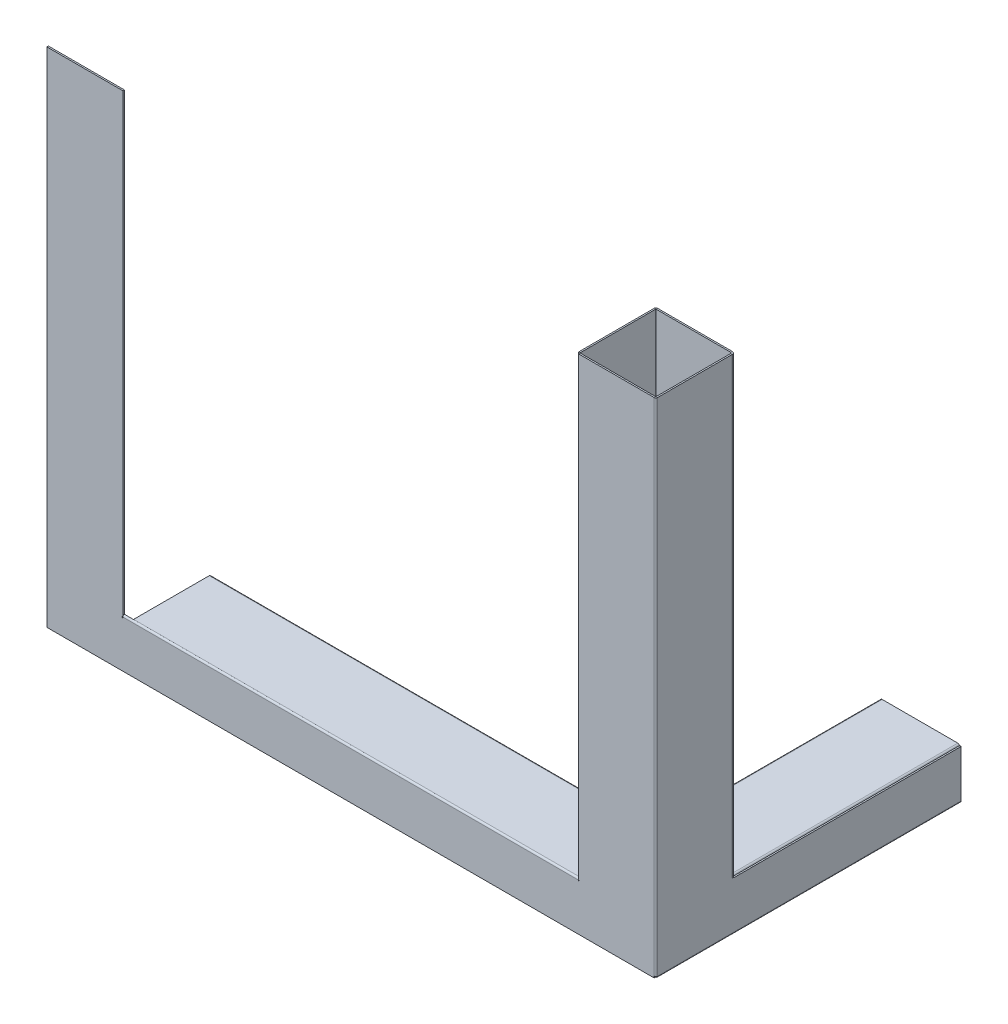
ISO-10303-21;
HEADER;
FILE_DESCRIPTION(('STEP AP214'),'2;1');
FILE_NAME('part.step','',(''),(''),'','','');
FILE_SCHEMA(('AUTOMOTIVE_DESIGN { 1 0 10303 214 1 1 1 1 }'));
ENDSEC;
DATA;
#1=APPLICATION_CONTEXT('core data for automotive mechanical design processes');
#2=APPLICATION_PROTOCOL_DEFINITION('international standard','automotive_design',2000,#1);
#3=PRODUCT_CONTEXT('',#1,'mechanical');
#4=PRODUCT('Part','Part','',(#3));
#5=PRODUCT_RELATED_PRODUCT_CATEGORY('part','',(#4));
#6=PRODUCT_DEFINITION_FORMATION('','',#4);
#7=PRODUCT_DEFINITION_CONTEXT('part definition',#1,'design');
#8=PRODUCT_DEFINITION('design','',#6,#7);
#9=PRODUCT_DEFINITION_SHAPE('','',#8);
#10=(LENGTH_UNIT() NAMED_UNIT(*) SI_UNIT(.MILLI.,.METRE.));
#11=(NAMED_UNIT(*) PLANE_ANGLE_UNIT() SI_UNIT($,.RADIAN.));
#12=(NAMED_UNIT(*) SI_UNIT($,.STERADIAN.) SOLID_ANGLE_UNIT());
#13=UNCERTAINTY_MEASURE_WITH_UNIT(LENGTH_MEASURE(1.E-05),#10,'distance_accuracy_value','');
#14=(GEOMETRIC_REPRESENTATION_CONTEXT(3) GLOBAL_UNCERTAINTY_ASSIGNED_CONTEXT((#13)) GLOBAL_UNIT_ASSIGNED_CONTEXT((#10,
#11,#12)) REPRESENTATION_CONTEXT('',''));
#15=CARTESIAN_POINT('',(0.,0.,0.));
#16=DIRECTION('',(0.,0.,1.));
#17=DIRECTION('',(1.,0.,0.));
#18=AXIS2_PLACEMENT_3D('',#15,#16,#17);
#19=CARTESIAN_POINT('',(-51.0999999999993,1.90000000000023,-200.));
#20=DIRECTION('',(0.,0.,1.));
#21=DIRECTION('',(1.,0.,0.));
#22=AXIS2_PLACEMENT_3D('',#19,#20,#21);
#23=PLANE('',#22);
#24=DIRECTION('',(2.6367796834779E-12,1.,0.));
#25=VECTOR('',#24,1.);
#26=CARTESIAN_POINT('',(-50.9999999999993,0.9000000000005,-200.));
#27=LINE('',#26,#25);
#28=CARTESIAN_POINT('',(-50.9999999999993,0.900000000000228,-200.));
#29=VERTEX_POINT('',#28);
#30=CARTESIAN_POINT('',(-50.9999999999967,1.9000000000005,-200.));
#31=VERTEX_POINT('',#30);
#32=EDGE_CURVE('E466',#29,#31,#27,.T.);
#33=ORIENTED_EDGE('',*,*,#32,.T.);
#34=DIRECTION('',(-1.,0.,0.));
#35=VECTOR('',#34,1.);
#36=CARTESIAN_POINT('',(-51.0999999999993,1.90000000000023,-200.));
#37=LINE('',#36,#35);
#38=CARTESIAN_POINT('',(-1.1999999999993,1.90000000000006,-200.));
#39=VERTEX_POINT('',#38);
#40=EDGE_CURVE('E489',#39,#31,#37,.T.);
#41=ORIENTED_EDGE('',*,*,#40,.F.);
#42=DIRECTION('',(0.,1.,0.));
#43=VECTOR('',#42,1.);
#44=CARTESIAN_POINT('',(-1.1999999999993,0.900000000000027,-200.));
#45=LINE('',#44,#43);
#46=CARTESIAN_POINT('',(-1.19999999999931,0.900000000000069,-200.));
#47=VERTEX_POINT('',#46);
#48=EDGE_CURVE('E480',#47,#39,#45,.T.);
#49=ORIENTED_EDGE('',*,*,#48,.F.);
#50=DIRECTION('',(-1.,0.,0.));
#51=VECTOR('',#50,1.);
#52=CARTESIAN_POINT('',(-51.0999999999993,0.900000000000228,-200.));
#53=LINE('',#52,#51);
#54=EDGE_CURVE('E488',#47,#29,#53,.T.);
#55=ORIENTED_EDGE('',*,*,#54,.T.);
#56=EDGE_LOOP('',(#33,#41,#49,#55));
#57=FACE_BOUND('',#56,.T.);
#58=ADVANCED_FACE('F36',(#57),#23,.F.);
#59=CARTESIAN_POINT('',(-1.09999999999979,1.90000000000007,-51.25));
#60=DIRECTION('',(0.,0.,-1.));
#61=DIRECTION('',(-1.,0.,0.));
#62=AXIS2_PLACEMENT_3D('',#59,#60,#61);
#63=PLANE('',#62);
#64=DIRECTION('',(2.6367796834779E-12,1.,5.55111512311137E-13));
#65=VECTOR('',#64,1.);
#66=CARTESIAN_POINT('',(-50.9999999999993,0.9000000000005,-51.2500000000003));
#67=LINE('',#66,#65);
#68=CARTESIAN_POINT('',(-50.9999999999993,0.9000000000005,-51.2500000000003));
#69=VERTEX_POINT('',#68);
#70=CARTESIAN_POINT('',(-50.9999999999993,1.90000000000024,-51.2500000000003));
#71=VERTEX_POINT('',#70);
#72=EDGE_CURVE('E472',#69,#71,#67,.T.);
#73=ORIENTED_EDGE('',*,*,#72,.F.);
#74=DIRECTION('',(1.,0.,0.));
#75=VECTOR('',#74,1.);
#76=CARTESIAN_POINT('',(-1.09999999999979,0.900000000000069,-51.25));
#77=LINE('',#76,#75);
#78=CARTESIAN_POINT('',(-1.19999999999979,0.900000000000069,-51.25));
#79=VERTEX_POINT('',#78);
#80=EDGE_CURVE('E492',#69,#79,#77,.T.);
#81=ORIENTED_EDGE('',*,*,#80,.T.);
#82=DIRECTION('',(0.,1.,0.));
#83=VECTOR('',#82,1.);
#84=CARTESIAN_POINT('',(-1.19999999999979,0.900000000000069,-51.2500000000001));
#85=LINE('',#84,#83);
#86=CARTESIAN_POINT('',(-1.19999999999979,1.90000000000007,-51.25));
#87=VERTEX_POINT('',#86);
#88=EDGE_CURVE('E475',#79,#87,#85,.T.);
#89=ORIENTED_EDGE('',*,*,#88,.T.);
#90=DIRECTION('',(1.,0.,0.));
#91=VECTOR('',#90,1.);
#92=CARTESIAN_POINT('',(-1.09999999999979,1.90000000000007,-51.25));
#93=LINE('',#92,#91);
#94=EDGE_CURVE('E491',#71,#87,#93,.T.);
#95=ORIENTED_EDGE('',*,*,#94,.F.);
#96=EDGE_LOOP('',(#73,#81,#89,#95));
#97=FACE_BOUND('',#96,.T.);
#98=ADVANCED_FACE('F747',(#97),#63,.F.);
#99=CARTESIAN_POINT('',(-1.0999999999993,1.90000000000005,-200.));
#100=DIRECTION('',(0.,-1.,0.));
#101=DIRECTION('',(1.,0.,0.));
#102=AXIS2_PLACEMENT_3D('',#99,#100,#101);
#103=PLANE('',#102);
#104=DIRECTION('',(0.,0.,-1.));
#105=VECTOR('',#104,1.);
#106=CARTESIAN_POINT('',(-50.9999999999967,1.9000000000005,-200.));
#107=LINE('',#106,#105);
#108=EDGE_CURVE('E419',#31,#71,#107,.F.);
#109=ORIENTED_EDGE('',*,*,#108,.T.);
#110=ORIENTED_EDGE('',*,*,#94,.T.);
#111=DIRECTION('',(0.,0.,1.));
#112=VECTOR('',#111,1.);
#113=CARTESIAN_POINT('',(-1.1999999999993,1.90000000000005,-200.));
#114=LINE('',#113,#112);
#115=EDGE_CURVE('E483',#39,#87,#114,.T.);
#116=ORIENTED_EDGE('',*,*,#115,.F.);
#117=ORIENTED_EDGE('',*,*,#40,.T.);
#118=EDGE_LOOP('',(#109,#110,#116,#117));
#119=FACE_BOUND('',#118,.T.);
#120=ADVANCED_FACE('F781',(#119),#103,.F.);
#121=CARTESIAN_POINT('',(-1.0999999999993,0.900000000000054,-200.));
#122=DIRECTION('',(0.,-1.,0.));
#123=DIRECTION('',(1.,0.,0.));
#124=AXIS2_PLACEMENT_3D('',#121,#122,#123);
#125=PLANE('',#124);
#126=ORIENTED_EDGE('',*,*,#80,.F.);
#127=DIRECTION('',(0.,0.,-1.));
#128=VECTOR('',#127,1.);
#129=CARTESIAN_POINT('',(-50.9999999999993,0.9000000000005,-200.));
#130=LINE('',#129,#128);
#131=EDGE_CURVE('E51',#29,#69,#130,.F.);
#132=ORIENTED_EDGE('',*,*,#131,.F.);
#133=ORIENTED_EDGE('',*,*,#54,.F.);
#134=DIRECTION('',(0.,0.,-1.));
#135=VECTOR('',#134,1.);
#136=CARTESIAN_POINT('',(-1.19999999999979,0.900000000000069,-51.2500000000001));
#137=LINE('',#136,#135);
#138=EDGE_CURVE('E478',#79,#47,#137,.T.);
#139=ORIENTED_EDGE('',*,*,#138,.F.);
#140=EDGE_LOOP('',(#126,#132,#133,#139));
#141=FACE_BOUND('',#140,.T.);
#142=ADVANCED_FACE('F748',(#141),#125,.T.);
#143=CARTESIAN_POINT('',(-1.09999999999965,0.900000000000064,-100.05));
#144=DIRECTION('',(0.,-1.,0.));
#145=DIRECTION('',(0.,0.,1.));
#146=AXIS2_PLACEMENT_3D('',#143,#144,#145);
#147=PLANE('',#146);
#148=DIRECTION('',(0.,0.,1.));
#149=VECTOR('',#148,1.);
#150=CARTESIAN_POINT('',(-0.0999999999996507,0.900000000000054,-100.05));
#151=LINE('',#150,#149);
#152=CARTESIAN_POINT('',(-0.0999999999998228,0.900000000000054,-50.75));
#153=VERTEX_POINT('',#152);
#154=CARTESIAN_POINT('',(-0.0999999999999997,0.900000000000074,-0.100000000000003));
#155=VERTEX_POINT('',#154);
#156=EDGE_CURVE('E572',#153,#155,#151,.T.);
#157=ORIENTED_EDGE('',*,*,#156,.F.);
#158=DIRECTION('',(1.,0.,0.));
#159=VECTOR('',#158,1.);
#160=CARTESIAN_POINT('',(-1.0999999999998,0.900000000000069,-50.75));
#161=LINE('',#160,#159);
#162=CARTESIAN_POINT('',(-1.09999999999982,0.900000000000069,-50.75));
#163=VERTEX_POINT('',#162);
#164=EDGE_CURVE('E529',#163,#153,#161,.T.);
#165=ORIENTED_EDGE('',*,*,#164,.F.);
#166=DIRECTION('',(0.,0.,1.));
#167=VECTOR('',#166,1.);
#168=CARTESIAN_POINT('',(-1.09999999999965,0.900000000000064,-100.05));
#169=LINE('',#168,#167);
#170=CARTESIAN_POINT('',(-1.1,0.900000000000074,-0.100000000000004));
#171=VERTEX_POINT('',#170);
#172=EDGE_CURVE('E560',#163,#171,#169,.T.);
#173=ORIENTED_EDGE('',*,*,#172,.T.);
#174=DIRECTION('',(-1.,0.,0.));
#175=VECTOR('',#174,1.);
#176=CARTESIAN_POINT('',(-1.1,0.900000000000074,-0.100000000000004));
#177=LINE('',#176,#175);
#178=EDGE_CURVE('E562',#155,#171,#177,.T.);
#179=ORIENTED_EDGE('',*,*,#178,.F.);
#180=EDGE_LOOP('',(#157,#165,#173,#179));
#181=FACE_BOUND('',#180,.T.);
#182=ADVANCED_FACE('F829',(#181),#147,.F.);
#183=CARTESIAN_POINT('',(-1.0999999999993,-14.5249999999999,-200.));
#184=DIRECTION('',(0.,0.,1.));
#185=DIRECTION('',(0.,1.,0.));
#186=AXIS2_PLACEMENT_3D('',#183,#184,#185);
#187=PLANE('',#186);
#188=DIRECTION('',(0.,1.,0.));
#189=VECTOR('',#188,1.);
#190=CARTESIAN_POINT('',(-1.0999999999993,-14.5249999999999,-200.));
#191=LINE('',#190,#189);
#192=CARTESIAN_POINT('',(-1.0999999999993,-29.9499999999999,-200.));
#193=VERTEX_POINT('',#192);
#194=CARTESIAN_POINT('',(-1.0999999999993,0.80000000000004,-200.));
#195=VERTEX_POINT('',#194);
#196=EDGE_CURVE('E569',#193,#195,#191,.T.);
#197=ORIENTED_EDGE('',*,*,#196,.T.);
#198=DIRECTION('',(1.,0.,0.));
#199=VECTOR('',#198,1.);
#200=CARTESIAN_POINT('',(-1.09999999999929,0.80000000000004,-200.));
#201=LINE('',#200,#199);
#202=CARTESIAN_POINT('',(-0.0999999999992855,0.799999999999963,-200.));
#203=VERTEX_POINT('',#202);
#204=EDGE_CURVE('E503',#195,#203,#201,.T.);
#205=ORIENTED_EDGE('',*,*,#204,.T.);
#206=DIRECTION('',(0.,1.,0.));
#207=VECTOR('',#206,1.);
#208=CARTESIAN_POINT('',(-0.0999999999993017,-14.5249999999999,-200.));
#209=LINE('',#208,#207);
#210=CARTESIAN_POINT('',(-0.0999999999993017,-29.9499999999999,-200.));
#211=VERTEX_POINT('',#210);
#212=EDGE_CURVE('E557',#211,#203,#209,.T.);
#213=ORIENTED_EDGE('',*,*,#212,.F.);
#214=DIRECTION('',(-1.,0.,0.));
#215=VECTOR('',#214,1.);
#216=CARTESIAN_POINT('',(-1.0999999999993,-29.9499999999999,-200.));
#217=LINE('',#216,#215);
#218=EDGE_CURVE('E585',#211,#193,#217,.T.);
#219=ORIENTED_EDGE('',*,*,#218,.T.);
#220=EDGE_LOOP('',(#197,#205,#213,#219));
#221=FACE_BOUND('',#220,.T.);
#222=ADVANCED_FACE('F826',(#221),#187,.F.);
#223=CARTESIAN_POINT('',(-1.09999999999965,-14.5249999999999,-100.05));
#224=DIRECTION('',(-1.,0.,0.));
#225=DIRECTION('',(0.,0.,1.));
#226=AXIS2_PLACEMENT_3D('',#223,#224,#225);
#227=PLANE('',#226);
#228=DIRECTION('',(0.,-1.,0.));
#229=VECTOR('',#228,1.);
#230=CARTESIAN_POINT('',(-1.09999999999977,0.80000000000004,-51.25));
#231=LINE('',#230,#229);
#232=CARTESIAN_POINT('',(-1.09999999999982,0.80000000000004,-51.25));
#233=VERTEX_POINT('',#232);
#234=CARTESIAN_POINT('',(-1.09999999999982,0.30000000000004,-51.25));
#235=VERTEX_POINT('',#234);
#236=EDGE_CURVE('E59',#233,#235,#231,.T.);
#237=ORIENTED_EDGE('',*,*,#236,.F.);
#238=DIRECTION('',(0.,0.,-1.));
#239=VECTOR('',#238,1.);
#240=CARTESIAN_POINT('',(-1.09999999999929,0.80000000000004,-200.));
#241=LINE('',#240,#239);
#242=EDGE_CURVE('E509',#195,#233,#241,.F.);
#243=ORIENTED_EDGE('',*,*,#242,.F.);
#244=ORIENTED_EDGE('',*,*,#196,.F.);
#245=DIRECTION('',(0.,0.,-1.));
#246=VECTOR('',#245,1.);
#247=CARTESIAN_POINT('',(-1.09999999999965,-29.9499999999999,-100.05));
#248=LINE('',#247,#246);
#249=CARTESIAN_POINT('',(-1.1,-29.9499999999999,-0.100000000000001));
#250=VERTEX_POINT('',#249);
#251=EDGE_CURVE('E566',#250,#193,#248,.T.);
#252=ORIENTED_EDGE('',*,*,#251,.F.);
#253=DIRECTION('',(0.,-1.,0.));
#254=VECTOR('',#253,1.);
#255=CARTESIAN_POINT('',(-1.1,-14.5249999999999,-0.100000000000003));
#256=LINE('',#255,#254);
#257=EDGE_CURVE('E563',#171,#250,#256,.T.);
#258=ORIENTED_EDGE('',*,*,#257,.F.);
#259=ORIENTED_EDGE('',*,*,#172,.F.);
#260=DIRECTION('',(0.,1.,0.));
#261=VECTOR('',#260,1.);
#262=CARTESIAN_POINT('',(-1.09999999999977,0.30000000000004,-50.75));
#263=LINE('',#262,#261);
#264=CARTESIAN_POINT('',(-1.09999999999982,0.30000000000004,-50.75));
#265=VERTEX_POINT('',#264);
#266=EDGE_CURVE('E526',#265,#163,#263,.T.);
#267=ORIENTED_EDGE('',*,*,#266,.F.);
#268=DIRECTION('',(0.,0.,1.));
#269=VECTOR('',#268,1.);
#270=CARTESIAN_POINT('',(-1.09999999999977,0.30000000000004,-51.25));
#271=LINE('',#270,#269);
#272=EDGE_CURVE('E522',#235,#265,#271,.T.);
#273=ORIENTED_EDGE('',*,*,#272,.F.);
#274=EDGE_LOOP('',(#237,#243,#244,#252,#258,#259,#267,#273));
#275=FACE_BOUND('',#274,.T.);
#276=ADVANCED_FACE('F822',(#275),#227,.T.);
#277=CARTESIAN_POINT('',(-0.0999999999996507,-14.5249999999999,-100.05));
#278=DIRECTION('',(-1.,0.,0.));
#279=DIRECTION('',(0.,0.,1.));
#280=AXIS2_PLACEMENT_3D('',#277,#278,#279);
#281=PLANE('',#280);
#282=DIRECTION('',(0.,0.,-1.));
#283=VECTOR('',#282,1.);
#284=CARTESIAN_POINT('',(-0.0999999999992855,0.799999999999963,-200.));
#285=LINE('',#284,#283);
#286=CARTESIAN_POINT('',(-0.0999999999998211,0.80000000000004,-51.25));
#287=VERTEX_POINT('',#286);
#288=EDGE_CURVE('E497',#203,#287,#285,.F.);
#289=ORIENTED_EDGE('',*,*,#288,.T.);
#290=DIRECTION('',(0.,1.,0.));
#291=VECTOR('',#290,1.);
#292=CARTESIAN_POINT('',(-0.0999999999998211,-14.5249999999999,-51.25));
#293=LINE('',#292,#291);
#294=CARTESIAN_POINT('',(-0.0999999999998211,0.30000000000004,-51.25));
#295=VERTEX_POINT('',#294);
#296=EDGE_CURVE('E12',#295,#287,#293,.T.);
#297=ORIENTED_EDGE('',*,*,#296,.F.);
#298=DIRECTION('',(0.,0.,-1.));
#299=VECTOR('',#298,1.);
#300=CARTESIAN_POINT('',(-0.0999999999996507,0.300000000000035,-100.05));
#301=LINE('',#300,#299);
#302=CARTESIAN_POINT('',(-0.0999999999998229,0.30000000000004,-50.75));
#303=VERTEX_POINT('',#302);
#304=EDGE_CURVE('E44',#303,#295,#301,.T.);
#305=ORIENTED_EDGE('',*,*,#304,.F.);
#306=DIRECTION('',(0.,-1.,0.));
#307=VECTOR('',#306,1.);
#308=CARTESIAN_POINT('',(-0.0999999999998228,-14.5249999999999,-50.75));
#309=LINE('',#308,#307);
#310=EDGE_CURVE('E726',#153,#303,#309,.T.);
#311=ORIENTED_EDGE('',*,*,#310,.F.);
#312=ORIENTED_EDGE('',*,*,#156,.T.);
#313=DIRECTION('',(0.,1.,0.));
#314=VECTOR('',#313,1.);
#315=CARTESIAN_POINT('',(-0.0999999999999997,-14.5249999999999,-0.100000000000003));
#316=LINE('',#315,#314);
#317=CARTESIAN_POINT('',(-0.0999999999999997,-29.9499999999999,-0.100000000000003));
#318=VERTEX_POINT('',#317);
#319=EDGE_CURVE('E574',#155,#318,#316,.F.);
#320=ORIENTED_EDGE('',*,*,#319,.T.);
#321=DIRECTION('',(0.,0.,1.));
#322=VECTOR('',#321,1.);
#323=CARTESIAN_POINT('',(-0.0999999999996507,-29.9499999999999,-100.05));
#324=LINE('',#323,#322);
#325=EDGE_CURVE('E577',#318,#211,#324,.F.);
#326=ORIENTED_EDGE('',*,*,#325,.T.);
#327=ORIENTED_EDGE('',*,*,#212,.T.);
#328=EDGE_LOOP('',(#289,#297,#305,#311,#312,#320,#326,#327));
#329=FACE_BOUND('',#328,.T.);
#330=ADVANCED_FACE('F825',(#329),#281,.F.);
#331=CARTESIAN_POINT('',(-0.0999999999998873,-29.9499999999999,0.999999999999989));
#332=DIRECTION('',(-1.,0.,1.12255582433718E-13));
#333=DIRECTION('',(1.12255582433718E-13,0.,1.));
#334=AXIS2_PLACEMENT_3D('',#331,#332,#333);
#335=PLANE('',#334);
#336=DIRECTION('',(-1.12255582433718E-13,0.,-1.));
#337=VECTOR('',#336,1.);
#338=CARTESIAN_POINT('',(-0.0999999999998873,-29.9499999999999,0.999999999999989));
#339=LINE('',#338,#337);
#340=CARTESIAN_POINT('',(-0.0999999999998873,-29.9499999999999,0.999999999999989));
#341=VERTEX_POINT('',#340);
#342=CARTESIAN_POINT('',(-0.0999999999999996,-29.9499999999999,0.));
#343=VERTEX_POINT('',#342);
#344=EDGE_CURVE('E724',#341,#343,#339,.T.);
#345=ORIENTED_EDGE('',*,*,#344,.F.);
#346=DIRECTION('',(0.,-1.,0.));
#347=VECTOR('',#346,1.);
#348=CARTESIAN_POINT('',(-0.0999999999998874,-31.,0.999999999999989));
#349=LINE('',#348,#347);
#350=CARTESIAN_POINT('',(-0.0999999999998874,-30.9999999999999,0.999999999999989));
#351=VERTEX_POINT('',#350);
#352=EDGE_CURVE('E1102',#351,#341,#349,.F.);
#353=ORIENTED_EDGE('',*,*,#352,.F.);
#354=DIRECTION('',(1.12214924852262E-13,0.,1.));
#355=VECTOR('',#354,1.);
#356=CARTESIAN_POINT('',(-0.0999999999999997,-30.9999999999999,0.));
#357=LINE('',#356,#355);
#358=CARTESIAN_POINT('',(-0.0999999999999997,-30.9999999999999,0.));
#359=VERTEX_POINT('',#358);
#360=EDGE_CURVE('E1110',#359,#351,#357,.T.);
#361=ORIENTED_EDGE('',*,*,#360,.F.);
#362=DIRECTION('',(0.,-1.,0.));
#363=VECTOR('',#362,1.);
#364=CARTESIAN_POINT('',(-0.0999999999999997,-31.,0.));
#365=LINE('',#364,#363);
#366=EDGE_CURVE('E1118',#359,#343,#365,.F.);
#367=ORIENTED_EDGE('',*,*,#366,.T.);
#368=EDGE_LOOP('',(#345,#353,#361,#367));
#369=FACE_BOUND('',#368,.T.);
#370=ADVANCED_FACE('F38',(#369),#335,.F.);
#371=CARTESIAN_POINT('',(-0.100000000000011,-31.,-0.1));
#372=DIRECTION('',(0.,-1.,0.));
#373=DIRECTION('',(1.,0.,0.));
#374=AXIS2_PLACEMENT_3D('',#371,#372,#373);
#375=CYLINDRICAL_SURFACE('',#374,1.09999999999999);
#376=CARTESIAN_POINT('',(-0.0999999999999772,300.,1.));
#377=VERTEX_POINT('',#376);
#378=EDGE_CURVE('E1097',#341,#377,#349,.F.);
#379=ORIENTED_EDGE('',*,*,#378,.F.);
#380=CARTESIAN_POINT('',(-0.100000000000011,-29.9499999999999,-0.1));
#381=DIRECTION('',(0.,-1.,0.));
#382=DIRECTION('',(0.,0.,-1.));
#383=AXIS2_PLACEMENT_3D('',#380,#381,#382);
#384=CIRCLE('',#383,1.09999999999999);
#385=CARTESIAN_POINT('',(1.,-29.9499999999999,-0.0999999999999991));
#386=VERTEX_POINT('',#385);
#387=EDGE_CURVE('E720',#341,#386,#384,.F.);
#388=ORIENTED_EDGE('',*,*,#387,.T.);
#389=DIRECTION('',(0.,1.,0.));
#390=VECTOR('',#389,1.);
#391=CARTESIAN_POINT('',(1.,-30.9999999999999,-0.0999999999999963));
#392=LINE('',#391,#390);
#393=CARTESIAN_POINT('',(1.,300.,-0.0999999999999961));
#394=VERTEX_POINT('',#393);
#395=EDGE_CURVE('E1342',#386,#394,#392,.T.);
#396=ORIENTED_EDGE('',*,*,#395,.T.);
#397=CARTESIAN_POINT('',(-0.0999999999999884,300.,-0.1));
#398=DIRECTION('',(0.,-1.,0.));
#399=DIRECTION('',(1.,0.,0.));
#400=AXIS2_PLACEMENT_3D('',#397,#398,#399);
#401=CIRCLE('',#400,1.09999999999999);
#402=EDGE_CURVE('E1100',#377,#394,#401,.F.);
#403=ORIENTED_EDGE('',*,*,#402,.F.);
#404=EDGE_LOOP('',(#379,#388,#396,#403));
#405=FACE_BOUND('',#404,.T.);
#406=ADVANCED_FACE('F892',(#405),#375,.T.);
#407=CARTESIAN_POINT('',(-49.9999999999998,1.34999999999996,-51.0000000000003));
#408=DIRECTION('',(0.,1.,0.));
#409=DIRECTION('',(0.,0.,1.));
#410=AXIS2_PLACEMENT_3D('',#407,#408,#409);
#411=PLANE('',#410);
#412=DIRECTION('',(0.,0.,-1.));
#413=VECTOR('',#412,1.);
#414=CARTESIAN_POINT('',(-49.8999999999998,1.34999999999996,-50.0000000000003));
#415=LINE('',#414,#413);
#416=CARTESIAN_POINT('',(-49.8999999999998,1.34999999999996,-50.0000000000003));
#417=VERTEX_POINT('',#416);
#418=CARTESIAN_POINT('',(-49.8999999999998,1.34999999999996,-51.0000000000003));
#419=VERTEX_POINT('',#418);
#420=EDGE_CURVE('E625',#417,#419,#415,.T.);
#421=ORIENTED_EDGE('',*,*,#420,.T.);
#422=DIRECTION('',(-1.,0.,0.));
#423=VECTOR('',#422,1.);
#424=CARTESIAN_POINT('',(-49.9999999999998,1.34999999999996,-51.0000000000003));
#425=LINE('',#424,#423);
#426=CARTESIAN_POINT('',(-0.736600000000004,1.34999999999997,-51.));
#427=VERTEX_POINT('',#426);
#428=EDGE_CURVE('E653',#427,#419,#425,.T.);
#429=ORIENTED_EDGE('',*,*,#428,.F.);
#430=DIRECTION('',(0.,0.,-1.));
#431=VECTOR('',#430,1.);
#432=CARTESIAN_POINT('',(-0.736600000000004,1.34999999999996,-49.9999999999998));
#433=LINE('',#432,#431);
#434=CARTESIAN_POINT('',(-0.736599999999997,1.34999999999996,-50.));
#435=VERTEX_POINT('',#434);
#436=EDGE_CURVE('E644',#435,#427,#433,.T.);
#437=ORIENTED_EDGE('',*,*,#436,.F.);
#438=DIRECTION('',(-1.,0.,0.));
#439=VECTOR('',#438,1.);
#440=CARTESIAN_POINT('',(-49.9999999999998,1.34999999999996,-50.0000000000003));
#441=LINE('',#440,#439);
#442=EDGE_CURVE('E652',#435,#417,#441,.T.);
#443=ORIENTED_EDGE('',*,*,#442,.T.);
#444=EDGE_LOOP('',(#421,#429,#437,#443));
#445=FACE_BOUND('',#444,.T.);
#446=ADVANCED_FACE('F888',(#445),#411,.F.);
#447=CARTESIAN_POINT('',(1.81557029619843E-13,300.,-51.));
#448=DIRECTION('',(0.,-1.,0.));
#449=DIRECTION('',(1.,0.,0.));
#450=AXIS2_PLACEMENT_3D('',#447,#448,#449);
#451=PLANE('',#450);
#452=DIRECTION('',(0.,1.11022302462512E-12,-1.));
#453=VECTOR('',#452,1.);
#454=CARTESIAN_POINT('',(-49.8999999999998,300.,-50.0000000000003));
#455=LINE('',#454,#453);
#456=CARTESIAN_POINT('',(-49.8999999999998,300.,-50.0000000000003));
#457=VERTEX_POINT('',#456);
#458=CARTESIAN_POINT('',(-49.8999999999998,300.,-51.0000000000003));
#459=VERTEX_POINT('',#458);
#460=EDGE_CURVE('E636',#457,#459,#455,.T.);
#461=ORIENTED_EDGE('',*,*,#460,.F.);
#462=DIRECTION('',(1.,0.,0.));
#463=VECTOR('',#462,1.);
#464=CARTESIAN_POINT('',(1.74574066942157E-13,300.,-50.));
#465=LINE('',#464,#463);
#466=CARTESIAN_POINT('',(-0.736599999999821,300.,-50.));
#467=VERTEX_POINT('',#466);
#468=EDGE_CURVE('E656',#457,#467,#465,.T.);
#469=ORIENTED_EDGE('',*,*,#468,.T.);
#470=DIRECTION('',(0.,0.,-1.));
#471=VECTOR('',#470,1.);
#472=CARTESIAN_POINT('',(-0.736599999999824,300.,-50.));
#473=LINE('',#472,#471);
#474=CARTESIAN_POINT('',(-0.736599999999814,300.,-51.));
#475=VERTEX_POINT('',#474);
#476=EDGE_CURVE('E639',#467,#475,#473,.T.);
#477=ORIENTED_EDGE('',*,*,#476,.T.);
#478=DIRECTION('',(1.,0.,0.));
#479=VECTOR('',#478,1.);
#480=CARTESIAN_POINT('',(1.81557029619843E-13,300.,-51.));
#481=LINE('',#480,#479);
#482=EDGE_CURVE('E655',#459,#475,#481,.T.);
#483=ORIENTED_EDGE('',*,*,#482,.F.);
#484=EDGE_LOOP('',(#461,#469,#477,#483));
#485=FACE_BOUND('',#484,.T.);
#486=ADVANCED_FACE('F880',(#485),#451,.F.);
#487=CARTESIAN_POINT('',(1.81557029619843E-13,300.,-51.));
#488=DIRECTION('',(0.,0.,1.));
#489=DIRECTION('',(1.,0.,0.));
#490=AXIS2_PLACEMENT_3D('',#487,#488,#489);
#491=PLANE('',#490);
#492=DIRECTION('',(0.,-1.,0.));
#493=VECTOR('',#492,1.);
#494=CARTESIAN_POINT('',(-49.8999999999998,1.35000000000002,-51.0000000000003));
#495=LINE('',#494,#493);
#496=EDGE_CURVE('E619',#419,#459,#495,.F.);
#497=ORIENTED_EDGE('',*,*,#496,.T.);
#498=ORIENTED_EDGE('',*,*,#482,.T.);
#499=DIRECTION('',(0.,1.,0.));
#500=VECTOR('',#499,1.);
#501=CARTESIAN_POINT('',(-0.736599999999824,300.,-51.));
#502=LINE('',#501,#500);
#503=EDGE_CURVE('E647',#427,#475,#502,.T.);
#504=ORIENTED_EDGE('',*,*,#503,.F.);
#505=ORIENTED_EDGE('',*,*,#428,.T.);
#506=EDGE_LOOP('',(#497,#498,#504,#505));
#507=FACE_BOUND('',#506,.T.);
#508=ADVANCED_FACE('F876',(#507),#491,.F.);
#509=CARTESIAN_POINT('',(1.74574066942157E-13,300.,-50.));
#510=DIRECTION('',(0.,0.,1.));
#511=DIRECTION('',(1.,0.,0.));
#512=AXIS2_PLACEMENT_3D('',#509,#510,#511);
#513=PLANE('',#512);
#514=ORIENTED_EDGE('',*,*,#468,.F.);
#515=DIRECTION('',(0.,-1.,0.));
#516=VECTOR('',#515,1.);
#517=CARTESIAN_POINT('',(-49.8999999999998,1.35000000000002,-50.0000000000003));
#518=LINE('',#517,#516);
#519=EDGE_CURVE('E631',#417,#457,#518,.F.);
#520=ORIENTED_EDGE('',*,*,#519,.F.);
#521=ORIENTED_EDGE('',*,*,#442,.F.);
#522=DIRECTION('',(0.,-1.,0.));
#523=VECTOR('',#522,1.);
#524=CARTESIAN_POINT('',(-0.736599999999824,300.,-50.));
#525=LINE('',#524,#523);
#526=EDGE_CURVE('E642',#467,#435,#525,.T.);
#527=ORIENTED_EDGE('',*,*,#526,.F.);
#528=EDGE_LOOP('',(#514,#520,#521,#527));
#529=FACE_BOUND('',#528,.T.);
#530=ADVANCED_FACE('F879',(#529),#513,.T.);
#531=CARTESIAN_POINT('',(1.,300.,0.));
#532=DIRECTION('',(0.,-1.,0.));
#533=DIRECTION('',(0.,0.,-1.));
#534=AXIS2_PLACEMENT_3D('',#531,#532,#533);
#535=PLANE('',#534);
#536=DIRECTION('',(1.,0.,0.));
#537=VECTOR('',#536,1.);
#538=CARTESIAN_POINT('',(2.68340037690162E-13,300.,-49.2633999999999));
#539=LINE('',#538,#537);
#540=CARTESIAN_POINT('',(2.68340037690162E-13,300.,-49.2633999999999));
#541=VERTEX_POINT('',#540);
#542=CARTESIAN_POINT('',(1.00000000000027,300.,-49.2633999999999));
#543=VERTEX_POINT('',#542);
#544=EDGE_CURVE('E669',#541,#543,#539,.T.);
#545=ORIENTED_EDGE('',*,*,#544,.F.);
#546=DIRECTION('',(0.,0.,1.));
#547=VECTOR('',#546,1.);
#548=CARTESIAN_POINT('',(0.,300.,0.));
#549=LINE('',#548,#547);
#550=CARTESIAN_POINT('',(0.,300.,-0.0999999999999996));
#551=VERTEX_POINT('',#550);
#552=EDGE_CURVE('E1113',#541,#551,#549,.T.);
#553=ORIENTED_EDGE('',*,*,#552,.T.);
#554=DIRECTION('',(1.,0.,0.));
#555=VECTOR('',#554,1.);
#556=CARTESIAN_POINT('',(0.,300.,-0.0999999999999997));
#557=LINE('',#556,#555);
#558=EDGE_CURVE('E717',#551,#394,#557,.T.);
#559=ORIENTED_EDGE('',*,*,#558,.T.);
#560=DIRECTION('',(0.,0.,1.));
#561=VECTOR('',#560,1.);
#562=CARTESIAN_POINT('',(1.,300.,0.));
#563=LINE('',#562,#561);
#564=EDGE_CURVE('E1345',#543,#394,#563,.T.);
#565=ORIENTED_EDGE('',*,*,#564,.F.);
#566=EDGE_LOOP('',(#545,#553,#559,#565));
#567=FACE_BOUND('',#566,.T.);
#568=ADVANCED_FACE('F884',(#567),#535,.F.);
#569=CARTESIAN_POINT('',(1.00000000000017,300.,-50.));
#570=DIRECTION('',(0.,0.,1.));
#571=DIRECTION('',(1.,0.,0.));
#572=AXIS2_PLACEMENT_3D('',#569,#570,#571);
#573=PLANE('',#572);
#574=DIRECTION('',(0.,1.,0.));
#575=VECTOR('',#574,1.);
#576=CARTESIAN_POINT('',(1.74574066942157E-13,300.,-50.));
#577=LINE('',#576,#575);
#578=CARTESIAN_POINT('',(1.74574066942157E-13,1.09999999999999,-50.));
#579=VERTEX_POINT('',#578);
#580=CARTESIAN_POINT('',(0.,1.34999999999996,-50.));
#581=VERTEX_POINT('',#580);
#582=EDGE_CURVE('E1340',#579,#581,#577,.T.);
#583=ORIENTED_EDGE('',*,*,#582,.T.);
#584=DIRECTION('',(1.,0.,0.));
#585=VECTOR('',#584,1.);
#586=CARTESIAN_POINT('',(0.,1.34999999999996,-50.));
#587=LINE('',#586,#585);
#588=CARTESIAN_POINT('',(0.836041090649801,1.34999999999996,-50.));
#589=VERTEX_POINT('',#588);
#590=EDGE_CURVE('E685',#581,#589,#587,.T.);
#591=ORIENTED_EDGE('',*,*,#590,.T.);
#592=CARTESIAN_POINT('',(1.00000000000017,1.34999999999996,-50.));
#593=VERTEX_POINT('',#592);
#594=EDGE_CURVE('E684',#589,#593,#587,.T.);
#595=ORIENTED_EDGE('',*,*,#594,.T.);
#596=DIRECTION('',(0.,1.,0.));
#597=VECTOR('',#596,1.);
#598=CARTESIAN_POINT('',(1.00000000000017,300.,-50.));
#599=LINE('',#598,#597);
#600=CARTESIAN_POINT('',(1.00000000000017,1.1,-50.));
#601=VERTEX_POINT('',#600);
#602=EDGE_CURVE('E707',#601,#593,#599,.T.);
#603=ORIENTED_EDGE('',*,*,#602,.F.);
#604=DIRECTION('',(1.,0.,0.));
#605=VECTOR('',#604,1.);
#606=CARTESIAN_POINT('',(1.00000000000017,1.1,-50.));
#607=LINE('',#606,#605);
#608=EDGE_CURVE('E691',#579,#601,#607,.T.);
#609=ORIENTED_EDGE('',*,*,#608,.F.);
#610=EDGE_LOOP('',(#583,#591,#595,#603,#609));
#611=FACE_BOUND('',#610,.T.);
#612=ADVANCED_FACE('F932',(#611),#573,.F.);
#613=CARTESIAN_POINT('',(-50.,300.,1.));
#614=DIRECTION('',(0.,0.,1.));
#615=DIRECTION('',(1.,0.,0.));
#616=AXIS2_PLACEMENT_3D('',#613,#614,#615);
#617=PLANE('',#616);
#618=DIRECTION('',(1.,0.,0.));
#619=VECTOR('',#618,1.);
#620=CARTESIAN_POINT('',(-400.,-31.,1.));
#621=LINE('',#620,#619);
#622=CARTESIAN_POINT('',(-400.,-31.,1.));
#623=VERTEX_POINT('',#622);
#624=EDGE_CURVE('E1107',#623,#351,#621,.T.);
#625=ORIENTED_EDGE('',*,*,#624,.T.);
#626=ORIENTED_EDGE('',*,*,#352,.T.);
#627=ORIENTED_EDGE('',*,*,#378,.T.);
#628=DIRECTION('',(-1.,0.,0.));
#629=VECTOR('',#628,1.);
#630=CARTESIAN_POINT('',(0.,300.,1.));
#631=LINE('',#630,#629);
#632=CARTESIAN_POINT('',(-50.,300.,1.));
#633=VERTEX_POINT('',#632);
#634=EDGE_CURVE('E1299',#377,#633,#631,.T.);
#635=ORIENTED_EDGE('',*,*,#634,.T.);
#636=DIRECTION('',(0.,-1.,0.));
#637=VECTOR('',#636,1.);
#638=CARTESIAN_POINT('',(-50.,300.,1.));
#639=LINE('',#638,#637);
#640=CARTESIAN_POINT('',(-50.,0.,1.));
#641=VERTEX_POINT('',#640);
#642=EDGE_CURVE('E1301',#633,#641,#639,.T.);
#643=ORIENTED_EDGE('',*,*,#642,.T.);
#644=DIRECTION('',(1.,0.,0.));
#645=VECTOR('',#644,1.);
#646=CARTESIAN_POINT('',(-50.,0.,1.));
#647=LINE('',#646,#645);
#648=CARTESIAN_POINT('',(-49.5,0.,1.));
#649=VERTEX_POINT('',#648);
#650=EDGE_CURVE('E1296',#641,#649,#647,.T.);
#651=ORIENTED_EDGE('',*,*,#650,.T.);
#652=DIRECTION('',(0.,-1.,0.));
#653=VECTOR('',#652,1.);
#654=CARTESIAN_POINT('',(-49.5,300.,1.));
#655=LINE('',#654,#653);
#656=CARTESIAN_POINT('',(-49.5,-0.599999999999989,1.));
#657=VERTEX_POINT('',#656);
#658=EDGE_CURVE('E1294',#649,#657,#655,.T.);
#659=ORIENTED_EDGE('',*,*,#658,.T.);
#660=DIRECTION('',(-1.,0.,0.));
#661=VECTOR('',#660,1.);
#662=CARTESIAN_POINT('',(-50.,-0.599999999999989,1.));
#663=LINE('',#662,#661);
#664=CARTESIAN_POINT('',(-50.,-0.600000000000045,1.));
#665=VERTEX_POINT('',#664);
#666=EDGE_CURVE('E1292',#657,#665,#663,.T.);
#667=ORIENTED_EDGE('',*,*,#666,.T.);
#668=DIRECTION('',(0.,1.,0.));
#669=VECTOR('',#668,1.);
#670=CARTESIAN_POINT('',(-50.,300.,1.));
#671=LINE('',#670,#669);
#672=CARTESIAN_POINT('',(-50.,-0.100000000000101,1.00000000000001));
#673=VERTEX_POINT('',#672);
#674=EDGE_CURVE('E1289',#665,#673,#671,.T.);
#675=ORIENTED_EDGE('',*,*,#674,.T.);
#676=DIRECTION('',(1.,0.,0.));
#677=VECTOR('',#676,1.);
#678=CARTESIAN_POINT('',(-50.,-0.100000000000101,1.00000000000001));
#679=LINE('',#678,#677);
#680=CARTESIAN_POINT('',(-350.,-0.099999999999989,1.));
#681=VERTEX_POINT('',#680);
#682=EDGE_CURVE('E1217',#673,#681,#679,.F.);
#683=ORIENTED_EDGE('',*,*,#682,.T.);
#684=DIRECTION('',(0.,-1.,0.));
#685=VECTOR('',#684,1.);
#686=CARTESIAN_POINT('',(-350.,300.,1.));
#687=LINE('',#686,#685);
#688=CARTESIAN_POINT('',(-350.,-0.600000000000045,1.));
#689=VERTEX_POINT('',#688);
#690=EDGE_CURVE('E1287',#681,#689,#687,.T.);
#691=ORIENTED_EDGE('',*,*,#690,.T.);
#692=DIRECTION('',(-1.,0.,0.));
#693=VECTOR('',#692,1.);
#694=CARTESIAN_POINT('',(-50.,-0.600000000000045,1.));
#695=LINE('',#694,#693);
#696=CARTESIAN_POINT('',(-350.5,-0.600000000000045,1.));
#697=VERTEX_POINT('',#696);
#698=EDGE_CURVE('E1285',#689,#697,#695,.T.);
#699=ORIENTED_EDGE('',*,*,#698,.T.);
#700=DIRECTION('',(0.,1.,0.));
#701=VECTOR('',#700,1.);
#702=CARTESIAN_POINT('',(-350.5,300.,1.));
#703=LINE('',#702,#701);
#704=CARTESIAN_POINT('',(-350.5,0.,1.));
#705=VERTEX_POINT('',#704);
#706=EDGE_CURVE('E1283',#697,#705,#703,.T.);
#707=ORIENTED_EDGE('',*,*,#706,.T.);
#708=DIRECTION('',(1.,0.,0.));
#709=VECTOR('',#708,1.);
#710=CARTESIAN_POINT('',(-50.,0.,1.));
#711=LINE('',#710,#709);
#712=CARTESIAN_POINT('',(-350.,0.,1.));
#713=VERTEX_POINT('',#712);
#714=EDGE_CURVE('E1243',#705,#713,#711,.T.);
#715=ORIENTED_EDGE('',*,*,#714,.T.);
#716=DIRECTION('',(0.,1.,0.));
#717=VECTOR('',#716,1.);
#718=CARTESIAN_POINT('',(-350.,0.,1.));
#719=LINE('',#718,#717);
#720=CARTESIAN_POINT('',(-350.,300.,1.));
#721=VERTEX_POINT('',#720);
#722=EDGE_CURVE('E1304',#713,#721,#719,.T.);
#723=ORIENTED_EDGE('',*,*,#722,.T.);
#724=DIRECTION('',(-1.,0.,0.));
#725=VECTOR('',#724,1.);
#726=CARTESIAN_POINT('',(-350.,300.,1.));
#727=LINE('',#726,#725);
#728=CARTESIAN_POINT('',(-400.,300.,1.));
#729=VERTEX_POINT('',#728);
#730=EDGE_CURVE('E1306',#721,#729,#727,.T.);
#731=ORIENTED_EDGE('',*,*,#730,.T.);
#732=DIRECTION('',(0.,-1.,0.));
#733=VECTOR('',#732,1.);
#734=CARTESIAN_POINT('',(-400.,300.,1.));
#735=LINE('',#734,#733);
#736=EDGE_CURVE('E1308',#729,#623,#735,.T.);
#737=ORIENTED_EDGE('',*,*,#736,.T.);
#738=EDGE_LOOP('',(#625,#626,#627,#635,#643,#651,#659,#667,#675,#683,#691,#699,#707,#715,#723,
#731,#737));
#739=FACE_BOUND('',#738,.T.);
#740=ADVANCED_FACE('F936',(#739),#617,.T.);
#741=CARTESIAN_POINT('',(-50.,300.,0.));
#742=DIRECTION('',(0.,0.,1.));
#743=DIRECTION('',(1.,0.,0.));
#744=AXIS2_PLACEMENT_3D('',#741,#742,#743);
#745=PLANE('',#744);
#746=ORIENTED_EDGE('',*,*,#366,.F.);
#747=DIRECTION('',(1.,0.,0.));
#748=VECTOR('',#747,1.);
#749=CARTESIAN_POINT('',(-400.,-31.,0.));
#750=LINE('',#749,#748);
#751=CARTESIAN_POINT('',(-400.,-31.,0.));
#752=VERTEX_POINT('',#751);
#753=EDGE_CURVE('E1302',#752,#359,#750,.T.);
#754=ORIENTED_EDGE('',*,*,#753,.F.);
#755=DIRECTION('',(0.,-1.,0.));
#756=VECTOR('',#755,1.);
#757=CARTESIAN_POINT('',(-400.,300.,0.));
#758=LINE('',#757,#756);
#759=CARTESIAN_POINT('',(-400.,300.,0.));
#760=VERTEX_POINT('',#759);
#761=EDGE_CURVE('E1320',#760,#752,#758,.T.);
#762=ORIENTED_EDGE('',*,*,#761,.F.);
#763=DIRECTION('',(-1.,0.,0.));
#764=VECTOR('',#763,1.);
#765=CARTESIAN_POINT('',(-350.,300.,0.));
#766=LINE('',#765,#764);
#767=CARTESIAN_POINT('',(-350.,300.,0.));
#768=VERTEX_POINT('',#767);
#769=EDGE_CURVE('E1318',#768,#760,#766,.T.);
#770=ORIENTED_EDGE('',*,*,#769,.F.);
#771=DIRECTION('',(0.,1.,0.));
#772=VECTOR('',#771,1.);
#773=CARTESIAN_POINT('',(-350.,0.,0.));
#774=LINE('',#773,#772);
#775=CARTESIAN_POINT('',(-350.,0.,0.));
#776=VERTEX_POINT('',#775);
#777=EDGE_CURVE('E1316',#776,#768,#774,.T.);
#778=ORIENTED_EDGE('',*,*,#777,.F.);
#779=DIRECTION('',(1.,0.,0.));
#780=VECTOR('',#779,1.);
#781=CARTESIAN_POINT('',(-350.5,0.,0.));
#782=LINE('',#781,#780);
#783=CARTESIAN_POINT('',(-350.5,0.,0.));
#784=VERTEX_POINT('',#783);
#785=EDGE_CURVE('E1267',#784,#776,#782,.T.);
#786=ORIENTED_EDGE('',*,*,#785,.F.);
#787=DIRECTION('',(0.,1.,0.));
#788=VECTOR('',#787,1.);
#789=CARTESIAN_POINT('',(-350.5,-0.60000000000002,0.));
#790=LINE('',#789,#788);
#791=CARTESIAN_POINT('',(-350.5,-0.600000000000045,0.));
#792=VERTEX_POINT('',#791);
#793=EDGE_CURVE('E1263',#792,#784,#790,.T.);
#794=ORIENTED_EDGE('',*,*,#793,.F.);
#795=DIRECTION('',(-1.,0.,0.));
#796=VECTOR('',#795,1.);
#797=CARTESIAN_POINT('',(-350.,-0.60000000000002,0.));
#798=LINE('',#797,#796);
#799=CARTESIAN_POINT('',(-350.,-0.600000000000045,0.));
#800=VERTEX_POINT('',#799);
#801=EDGE_CURVE('E1259',#800,#792,#798,.T.);
#802=ORIENTED_EDGE('',*,*,#801,.F.);
#803=DIRECTION('',(0.,-1.,0.));
#804=VECTOR('',#803,1.);
#805=CARTESIAN_POINT('',(-350.,-0.10000000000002,0.));
#806=LINE('',#805,#804);
#807=CARTESIAN_POINT('',(-350.,-0.10000000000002,0.));
#808=VERTEX_POINT('',#807);
#809=EDGE_CURVE('E1256',#808,#800,#806,.T.);
#810=ORIENTED_EDGE('',*,*,#809,.F.);
#811=DIRECTION('',(1.,0.,0.));
#812=VECTOR('',#811,1.);
#813=CARTESIAN_POINT('',(-50.,-0.0999999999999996,0.));
#814=LINE('',#813,#812);
#815=CARTESIAN_POINT('',(-50.,-0.0999999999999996,0.));
#816=VERTEX_POINT('',#815);
#817=EDGE_CURVE('E1230',#816,#808,#814,.F.);
#818=ORIENTED_EDGE('',*,*,#817,.F.);
#819=DIRECTION('',(0.,1.,0.));
#820=VECTOR('',#819,1.);
#821=CARTESIAN_POINT('',(-50.,-0.6,0.));
#822=LINE('',#821,#820);
#823=CARTESIAN_POINT('',(-50.,-0.600000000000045,0.));
#824=VERTEX_POINT('',#823);
#825=EDGE_CURVE('E1252',#824,#816,#822,.T.);
#826=ORIENTED_EDGE('',*,*,#825,.F.);
#827=DIRECTION('',(-1.,0.,0.));
#828=VECTOR('',#827,1.);
#829=CARTESIAN_POINT('',(-49.5,-0.6,0.));
#830=LINE('',#829,#828);
#831=CARTESIAN_POINT('',(-49.5,-0.599999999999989,0.));
#832=VERTEX_POINT('',#831);
#833=EDGE_CURVE('E1248',#832,#824,#830,.T.);
#834=ORIENTED_EDGE('',*,*,#833,.F.);
#835=DIRECTION('',(0.,-1.,0.));
#836=VECTOR('',#835,1.);
#837=CARTESIAN_POINT('',(-49.5,0.,0.));
#838=LINE('',#837,#836);
#839=CARTESIAN_POINT('',(-49.5,0.,0.));
#840=VERTEX_POINT('',#839);
#841=EDGE_CURVE('E1244',#840,#832,#838,.T.);
#842=ORIENTED_EDGE('',*,*,#841,.F.);
#843=DIRECTION('',(1.,0.,0.));
#844=VECTOR('',#843,1.);
#845=CARTESIAN_POINT('',(-50.,0.,0.));
#846=LINE('',#845,#844);
#847=CARTESIAN_POINT('',(-50.,0.,0.));
#848=VERTEX_POINT('',#847);
#849=EDGE_CURVE('E1240',#848,#840,#846,.T.);
#850=ORIENTED_EDGE('',*,*,#849,.F.);
#851=DIRECTION('',(0.,-1.,0.));
#852=VECTOR('',#851,1.);
#853=CARTESIAN_POINT('',(-50.,300.,0.));
#854=LINE('',#853,#852);
#855=CARTESIAN_POINT('',(-50.,300.,0.));
#856=VERTEX_POINT('',#855);
#857=EDGE_CURVE('E1313',#856,#848,#854,.T.);
#858=ORIENTED_EDGE('',*,*,#857,.F.);
#859=DIRECTION('',(-1.,0.,0.));
#860=VECTOR('',#859,1.);
#861=CARTESIAN_POINT('',(0.,300.,0.));
#862=LINE('',#861,#860);
#863=CARTESIAN_POINT('',(-0.0999999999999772,300.,0.));
#864=VERTEX_POINT('',#863);
#865=EDGE_CURVE('E1298',#864,#856,#862,.T.);
#866=ORIENTED_EDGE('',*,*,#865,.F.);
#867=EDGE_CURVE('E1121',#343,#864,#365,.F.);
#868=ORIENTED_EDGE('',*,*,#867,.F.);
#869=EDGE_LOOP('',(#746,#754,#762,#770,#778,#786,#794,#802,#810,#818,#826,#834,#842,#850,#858,
#866,#868));
#870=FACE_BOUND('',#869,.T.);
#871=ADVANCED_FACE('F1062',(#870),#745,.F.);
#872=CARTESIAN_POINT('',(0.,300.,1.));
#873=DIRECTION('',(0.,-1.,0.));
#874=DIRECTION('',(0.,0.,-1.));
#875=AXIS2_PLACEMENT_3D('',#872,#873,#874);
#876=PLANE('',#875);
#877=DIRECTION('',(1.12214924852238E-13,0.,1.));
#878=VECTOR('',#877,1.);
#879=CARTESIAN_POINT('',(-0.0999999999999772,300.,0.));
#880=LINE('',#879,#878);
#881=EDGE_CURVE('E1122',#864,#377,#880,.T.);
#882=ORIENTED_EDGE('',*,*,#881,.F.);
#883=ORIENTED_EDGE('',*,*,#865,.T.);
#884=DIRECTION('',(0.,0.,-1.));
#885=VECTOR('',#884,1.);
#886=CARTESIAN_POINT('',(-50.,300.,1.));
#887=LINE('',#886,#885);
#888=EDGE_CURVE('E1338',#633,#856,#887,.T.);
#889=ORIENTED_EDGE('',*,*,#888,.F.);
#890=ORIENTED_EDGE('',*,*,#634,.F.);
#891=EDGE_LOOP('',(#882,#883,#889,#890));
#892=FACE_BOUND('',#891,.T.);
#893=ADVANCED_FACE('F1066',(#892),#876,.F.);
#894=CARTESIAN_POINT('',(-400.,-31.,1.));
#895=DIRECTION('',(0.,1.,0.));
#896=DIRECTION('',(-1.,0.,0.));
#897=AXIS2_PLACEMENT_3D('',#894,#895,#896);
#898=PLANE('',#897);
#899=ORIENTED_EDGE('',*,*,#360,.T.);
#900=ORIENTED_EDGE('',*,*,#624,.F.);
#901=DIRECTION('',(0.,0.,-1.));
#902=VECTOR('',#901,1.);
#903=CARTESIAN_POINT('',(-400.,-31.,1.));
#904=LINE('',#903,#902);
#905=EDGE_CURVE('E1311',#623,#752,#904,.T.);
#906=ORIENTED_EDGE('',*,*,#905,.T.);
#907=ORIENTED_EDGE('',*,*,#753,.T.);
#908=EDGE_LOOP('',(#899,#900,#906,#907));
#909=FACE_BOUND('',#908,.T.);
#910=ADVANCED_FACE('F1002',(#909),#898,.F.);
#911=CARTESIAN_POINT('',(-50.,1.,0.));
#912=DIRECTION('',(0.,-1.,0.));
#913=DIRECTION('',(0.,0.,-1.));
#914=AXIS2_PLACEMENT_3D('',#911,#912,#913);
#915=PLANE('',#914);
#916=DIRECTION('',(1.,0.,0.));
#917=VECTOR('',#916,1.);
#918=CARTESIAN_POINT('',(-50.,1.00000000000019,-49.9));
#919=LINE('',#918,#917);
#920=CARTESIAN_POINT('',(-50.,1.00000000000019,-49.9));
#921=VERTEX_POINT('',#920);
#922=CARTESIAN_POINT('',(-344.,1.00000000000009,-49.9));
#923=VERTEX_POINT('',#922);
#924=EDGE_CURVE('E1156',#921,#923,#919,.F.);
#925=ORIENTED_EDGE('',*,*,#924,.T.);
#926=DIRECTION('',(0.,0.,-1.));
#927=VECTOR('',#926,1.);
#928=CARTESIAN_POINT('',(-344.,1.,0.));
#929=LINE('',#928,#927);
#930=CARTESIAN_POINT('',(-344.,1.,-0.0999999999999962));
#931=VERTEX_POINT('',#930);
#932=EDGE_CURVE('E1196',#931,#923,#929,.T.);
#933=ORIENTED_EDGE('',*,*,#932,.F.);
#934=DIRECTION('',(-1.,0.,0.));
#935=VECTOR('',#934,1.);
#936=CARTESIAN_POINT('',(-50.,1.,-0.0999999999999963));
#937=LINE('',#936,#935);
#938=CARTESIAN_POINT('',(-50.,1.,-0.0999999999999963));
#939=VERTEX_POINT('',#938);
#940=EDGE_CURVE('E1208',#939,#931,#937,.T.);
#941=ORIENTED_EDGE('',*,*,#940,.F.);
#942=DIRECTION('',(0.,0.,-1.));
#943=VECTOR('',#942,1.);
#944=CARTESIAN_POINT('',(-50.,1.00000000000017,-50.));
#945=LINE('',#944,#943);
#946=EDGE_CURVE('E1212',#939,#921,#945,.T.);
#947=ORIENTED_EDGE('',*,*,#946,.T.);
#948=EDGE_LOOP('',(#925,#933,#941,#947));
#949=FACE_BOUND('',#948,.T.);
#950=ADVANCED_FACE('F998',(#949),#915,.F.);
#951=CARTESIAN_POINT('',(-50.,0.,0.));
#952=DIRECTION('',(0.,-1.,0.));
#953=DIRECTION('',(0.,0.,-1.));
#954=AXIS2_PLACEMENT_3D('',#951,#952,#953);
#955=PLANE('',#954);
#956=DIRECTION('',(0.,0.,-1.));
#957=VECTOR('',#956,1.);
#958=CARTESIAN_POINT('',(-344.,0.,-0.001000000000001));
#959=LINE('',#958,#957);
#960=CARTESIAN_POINT('',(-344.,0.,-0.0999999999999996));
#961=VERTEX_POINT('',#960);
#962=CARTESIAN_POINT('',(-344.,1.74224918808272E-13,-49.9));
#963=VERTEX_POINT('',#962);
#964=EDGE_CURVE('E1193',#961,#963,#959,.T.);
#965=ORIENTED_EDGE('',*,*,#964,.T.);
#966=DIRECTION('',(1.,0.,0.));
#967=VECTOR('',#966,1.);
#968=CARTESIAN_POINT('',(-50.,1.86211723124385E-13,-49.9));
#969=LINE('',#968,#967);
#970=CARTESIAN_POINT('',(-50.,1.74224918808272E-13,-49.9));
#971=VERTEX_POINT('',#970);
#972=EDGE_CURVE('E1169',#971,#963,#969,.F.);
#973=ORIENTED_EDGE('',*,*,#972,.F.);
#974=DIRECTION('',(0.,0.,-1.));
#975=VECTOR('',#974,1.);
#976=CARTESIAN_POINT('',(-50.,1.74574066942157E-13,-50.));
#977=LINE('',#976,#975);
#978=CARTESIAN_POINT('',(-50.,0.,-0.0999999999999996));
#979=VERTEX_POINT('',#978);
#980=EDGE_CURVE('E1211',#979,#971,#977,.T.);
#981=ORIENTED_EDGE('',*,*,#980,.F.);
#982=DIRECTION('',(1.,0.,0.));
#983=VECTOR('',#982,1.);
#984=CARTESIAN_POINT('',(-350.,0.,-0.0999999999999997));
#985=LINE('',#984,#983);
#986=EDGE_CURVE('E1203',#961,#979,#985,.T.);
#987=ORIENTED_EDGE('',*,*,#986,.F.);
#988=EDGE_LOOP('',(#965,#973,#981,#987));
#989=FACE_BOUND('',#988,.T.);
#990=ADVANCED_FACE('F1001',(#989),#955,.T.);
#991=CARTESIAN_POINT('',(-50.,1.00000000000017,-50.));
#992=DIRECTION('',(-1.,0.,0.));
#993=DIRECTION('',(0.,0.,1.));
#994=AXIS2_PLACEMENT_3D('',#991,#992,#993);
#995=PLANE('',#994);
#996=DIRECTION('',(0.,1.,0.));
#997=VECTOR('',#996,1.);
#998=CARTESIAN_POINT('',(-50.,1.86211723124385E-13,-49.9));
#999=LINE('',#998,#997);
#1000=EDGE_CURVE('E1163',#971,#921,#999,.T.);
#1001=ORIENTED_EDGE('',*,*,#1000,.T.);
#1002=ORIENTED_EDGE('',*,*,#946,.F.);
#1003=DIRECTION('',(0.,1.,0.));
#1004=VECTOR('',#1003,1.);
#1005=CARTESIAN_POINT('',(-50.,0.,-0.0999999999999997));
#1006=LINE('',#1005,#1004);
#1007=EDGE_CURVE('E1205',#979,#939,#1006,.T.);
#1008=ORIENTED_EDGE('',*,*,#1007,.F.);
#1009=ORIENTED_EDGE('',*,*,#980,.T.);
#1010=EDGE_LOOP('',(#1001,#1002,#1008,#1009));
#1011=FACE_BOUND('',#1010,.T.);
#1012=ADVANCED_FACE('F1006',(#1011),#995,.F.);
#1013=CARTESIAN_POINT('',(-350.,-0.10000000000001,-0.1));
#1014=DIRECTION('',(-1.,0.,0.));
#1015=DIRECTION('',(0.,-1.,0.));
#1016=AXIS2_PLACEMENT_3D('',#1013,#1014,#1015);
#1017=PLANE('',#1016);
#1018=CARTESIAN_POINT('',(-350.,-0.10000000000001,-0.1));
#1019=DIRECTION('',(1.,0.,0.));
#1020=DIRECTION('',(0.,1.,0.));
#1021=AXIS2_PLACEMENT_3D('',#1018,#1019,#1020);
#1022=CIRCLE('',#1021,1.10000000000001);
#1023=CARTESIAN_POINT('',(-350.,0.99553594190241,-0.000999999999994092));
#1024=VERTEX_POINT('',#1023);
#1025=EDGE_CURVE('E1220',#681,#1024,#1022,.F.);
#1026=ORIENTED_EDGE('',*,*,#1025,.T.);
#1027=DIRECTION('',(-1.00929365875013E-13,0.995941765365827,0.0900000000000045));
#1028=VECTOR('',#1027,1.);
#1029=CARTESIAN_POINT('',(-350.,0.99553594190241,-0.000999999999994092));
#1030=LINE('',#1029,#1028);
#1031=CARTESIAN_POINT('',(-350.,-0.000405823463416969,-0.0909999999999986));
#1032=VERTEX_POINT('',#1031);
#1033=EDGE_CURVE('E1190',#1024,#1032,#1030,.F.);
#1034=ORIENTED_EDGE('',*,*,#1033,.T.);
#1035=CARTESIAN_POINT('',(-350.,-0.10000000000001,-0.1));
#1036=DIRECTION('',(1.,0.,0.));
#1037=DIRECTION('',(0.,1.,0.));
#1038=AXIS2_PLACEMENT_3D('',#1035,#1036,#1037);
#1039=CIRCLE('',#1038,0.10000000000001);
#1040=EDGE_CURVE('E1227',#808,#1032,#1039,.F.);
#1041=ORIENTED_EDGE('',*,*,#1040,.F.);
#1042=DIRECTION('',(-1.11022302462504E-12,-1.01508428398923E-13,1.));
#1043=VECTOR('',#1042,1.);
#1044=CARTESIAN_POINT('',(-350.,-0.10000000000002,0.));
#1045=LINE('',#1044,#1043);
#1046=EDGE_CURVE('E1234',#808,#681,#1045,.T.);
#1047=ORIENTED_EDGE('',*,*,#1046,.T.);
#1048=EDGE_LOOP('',(#1026,#1034,#1041,#1047));
#1049=FACE_BOUND('',#1048,.T.);
#1050=ADVANCED_FACE('F1010',(#1049),#1017,.T.);
#1051=CARTESIAN_POINT('',(-50.,-0.0999999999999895,-0.1));
#1052=DIRECTION('',(1.,0.,0.));
#1053=DIRECTION('',(0.,1.,0.));
#1054=AXIS2_PLACEMENT_3D('',#1051,#1052,#1053);
#1055=CYLINDRICAL_SURFACE('',#1054,1.10000000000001);
#1056=CARTESIAN_POINT('',(-344.,-0.100000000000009,-0.1));
#1057=DIRECTION('',(1.,0.,0.));
#1058=DIRECTION('',(0.,0.,-1.));
#1059=AXIS2_PLACEMENT_3D('',#1056,#1057,#1058);
#1060=CIRCLE('',#1059,1.10000000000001);
#1061=CARTESIAN_POINT('',(-344.,0.99553594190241,-0.000999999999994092));
#1062=VERTEX_POINT('',#1061);
#1063=EDGE_CURVE('E1184',#1062,#931,#1060,.F.);
#1064=ORIENTED_EDGE('',*,*,#1063,.F.);
#1065=DIRECTION('',(1.,0.,0.));
#1066=VECTOR('',#1065,1.);
#1067=CARTESIAN_POINT('',(-50.,0.99553594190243,-0.000999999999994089));
#1068=LINE('',#1067,#1066);
#1069=EDGE_CURVE('E1177',#1024,#1062,#1068,.T.);
#1070=ORIENTED_EDGE('',*,*,#1069,.F.);
#1071=ORIENTED_EDGE('',*,*,#1025,.F.);
#1072=ORIENTED_EDGE('',*,*,#682,.F.);
#1073=CARTESIAN_POINT('',(-50.,-0.0999999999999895,-0.1));
#1074=DIRECTION('',(1.,0.,0.));
#1075=DIRECTION('',(0.,1.,0.));
#1076=AXIS2_PLACEMENT_3D('',#1073,#1074,#1075);
#1077=CIRCLE('',#1076,1.10000000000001);
#1078=EDGE_CURVE('E1221',#939,#673,#1077,.T.);
#1079=ORIENTED_EDGE('',*,*,#1078,.F.);
#1080=ORIENTED_EDGE('',*,*,#940,.T.);
#1081=EDGE_LOOP('',(#1064,#1070,#1071,#1072,#1079,#1080));
#1082=FACE_BOUND('',#1081,.T.);
#1083=ADVANCED_FACE('F1012',(#1082),#1055,.T.);
#1084=CARTESIAN_POINT('',(-50.,-0.0999999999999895,-0.1));
#1085=DIRECTION('',(1.,0.,0.));
#1086=DIRECTION('',(0.,1.,0.));
#1087=AXIS2_PLACEMENT_3D('',#1084,#1085,#1086);
#1088=CYLINDRICAL_SURFACE('',#1087,0.10000000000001);
#1089=DIRECTION('',(1.,0.,0.));
#1090=VECTOR('',#1089,1.);
#1091=CARTESIAN_POINT('',(-50.,-0.00040582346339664,-0.0909999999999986));
#1092=LINE('',#1091,#1090);
#1093=CARTESIAN_POINT('',(-344.,-0.000405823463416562,-0.0909999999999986));
#1094=VERTEX_POINT('',#1093);
#1095=EDGE_CURVE('E1180',#1032,#1094,#1092,.T.);
#1096=ORIENTED_EDGE('',*,*,#1095,.T.);
#1097=CARTESIAN_POINT('',(-344.,-0.100000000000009,-0.1));
#1098=DIRECTION('',(1.,0.,0.));
#1099=DIRECTION('',(0.,1.,0.));
#1100=AXIS2_PLACEMENT_3D('',#1097,#1098,#1099);
#1101=CIRCLE('',#1100,0.10000000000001);
#1102=EDGE_CURVE('E1183',#1094,#961,#1101,.F.);
#1103=ORIENTED_EDGE('',*,*,#1102,.T.);
#1104=ORIENTED_EDGE('',*,*,#986,.T.);
#1105=CARTESIAN_POINT('',(-50.,-0.0999999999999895,-0.1));
#1106=DIRECTION('',(1.,0.,0.));
#1107=DIRECTION('',(0.,1.,0.));
#1108=AXIS2_PLACEMENT_3D('',#1105,#1106,#1107);
#1109=CIRCLE('',#1108,0.10000000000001);
#1110=EDGE_CURVE('E1214',#979,#816,#1109,.T.);
#1111=ORIENTED_EDGE('',*,*,#1110,.T.);
#1112=ORIENTED_EDGE('',*,*,#817,.T.);
#1113=ORIENTED_EDGE('',*,*,#1040,.T.);
#1114=EDGE_LOOP('',(#1096,#1103,#1104,#1111,#1112,#1113));
#1115=FACE_BOUND('',#1114,.T.);
#1116=ADVANCED_FACE('F1015',(#1115),#1088,.F.);
#1117=CARTESIAN_POINT('',(-50.,300.,1.));
#1118=DIRECTION('',(1.,0.,0.));
#1119=DIRECTION('',(0.,0.,-1.));
#1120=AXIS2_PLACEMENT_3D('',#1117,#1118,#1119);
#1121=PLANE('',#1120);
#1122=ORIENTED_EDGE('',*,*,#857,.T.);
#1123=DIRECTION('',(0.,0.,-1.));
#1124=VECTOR('',#1123,1.);
#1125=CARTESIAN_POINT('',(-50.,0.,1.));
#1126=LINE('',#1125,#1124);
#1127=EDGE_CURVE('E1335',#641,#848,#1126,.T.);
#1128=ORIENTED_EDGE('',*,*,#1127,.F.);
#1129=ORIENTED_EDGE('',*,*,#642,.F.);
#1130=ORIENTED_EDGE('',*,*,#888,.T.);
#1131=EDGE_LOOP('',(#1122,#1128,#1129,#1130));
#1132=FACE_BOUND('',#1131,.T.);
#1133=ADVANCED_FACE('F1019',(#1132),#1121,.F.);
#1134=CARTESIAN_POINT('',(-350.,0.,1.));
#1135=DIRECTION('',(-1.,0.,0.));
#1136=DIRECTION('',(0.,0.,1.));
#1137=AXIS2_PLACEMENT_3D('',#1134,#1135,#1136);
#1138=PLANE('',#1137);
#1139=ORIENTED_EDGE('',*,*,#777,.T.);
#1140=DIRECTION('',(0.,0.,-1.));
#1141=VECTOR('',#1140,1.);
#1142=CARTESIAN_POINT('',(-350.,300.,1.));
#1143=LINE('',#1142,#1141);
#1144=EDGE_CURVE('E1329',#721,#768,#1143,.T.);
#1145=ORIENTED_EDGE('',*,*,#1144,.F.);
#1146=ORIENTED_EDGE('',*,*,#722,.F.);
#1147=DIRECTION('',(0.,0.,-1.));
#1148=VECTOR('',#1147,1.);
#1149=CARTESIAN_POINT('',(-350.,0.,1.));
#1150=LINE('',#1149,#1148);
#1151=EDGE_CURVE('E1332',#713,#776,#1150,.T.);
#1152=ORIENTED_EDGE('',*,*,#1151,.T.);
#1153=EDGE_LOOP('',(#1139,#1145,#1146,#1152));
#1154=FACE_BOUND('',#1153,.T.);
#1155=ADVANCED_FACE('F1077',(#1154),#1138,.F.);
#1156=CARTESIAN_POINT('',(-350.,300.,1.));
#1157=DIRECTION('',(0.,-1.,0.));
#1158=DIRECTION('',(0.,0.,-1.));
#1159=AXIS2_PLACEMENT_3D('',#1156,#1157,#1158);
#1160=PLANE('',#1159);
#1161=ORIENTED_EDGE('',*,*,#769,.T.);
#1162=DIRECTION('',(0.,0.,-1.));
#1163=VECTOR('',#1162,1.);
#1164=CARTESIAN_POINT('',(-400.,300.,1.));
#1165=LINE('',#1164,#1163);
#1166=EDGE_CURVE('E1326',#729,#760,#1165,.T.);
#1167=ORIENTED_EDGE('',*,*,#1166,.F.);
#1168=ORIENTED_EDGE('',*,*,#730,.F.);
#1169=ORIENTED_EDGE('',*,*,#1144,.T.);
#1170=EDGE_LOOP('',(#1161,#1167,#1168,#1169));
#1171=FACE_BOUND('',#1170,.T.);
#1172=ADVANCED_FACE('F1073',(#1171),#1160,.F.);
#1173=CARTESIAN_POINT('',(-400.,300.,1.));
#1174=DIRECTION('',(1.,0.,0.));
#1175=DIRECTION('',(0.,1.,0.));
#1176=AXIS2_PLACEMENT_3D('',#1173,#1174,#1175);
#1177=PLANE('',#1176);
#1178=ORIENTED_EDGE('',*,*,#761,.T.);
#1179=ORIENTED_EDGE('',*,*,#905,.F.);
#1180=ORIENTED_EDGE('',*,*,#736,.F.);
#1181=ORIENTED_EDGE('',*,*,#1166,.T.);
#1182=EDGE_LOOP('',(#1178,#1179,#1180,#1181));
#1183=FACE_BOUND('',#1182,.T.);
#1184=ADVANCED_FACE('F1033',(#1183),#1177,.F.);
#1185=CARTESIAN_POINT('',(-50.,0.,0.));
#1186=DIRECTION('',(0.,-1.,0.));
#1187=DIRECTION('',(0.,0.,-1.));
#1188=AXIS2_PLACEMENT_3D('',#1185,#1186,#1187);
#1189=PLANE('',#1188);
#1190=ORIENTED_EDGE('',*,*,#650,.F.);
#1191=ORIENTED_EDGE('',*,*,#1127,.T.);
#1192=ORIENTED_EDGE('',*,*,#849,.T.);
#1193=DIRECTION('',(0.,0.,1.));
#1194=VECTOR('',#1193,1.);
#1195=CARTESIAN_POINT('',(-49.5,0.,0.));
#1196=LINE('',#1195,#1194);
#1197=EDGE_CURVE('E1247',#840,#649,#1196,.T.);
#1198=ORIENTED_EDGE('',*,*,#1197,.T.);
#1199=EDGE_LOOP('',(#1190,#1191,#1192,#1198));
#1200=FACE_BOUND('',#1199,.T.);
#1201=ADVANCED_FACE('F1028',(#1200),#1189,.T.);
#1202=CARTESIAN_POINT('',(-49.5,0.,0.));
#1203=DIRECTION('',(-1.,0.,0.));
#1204=DIRECTION('',(0.,0.,1.));
#1205=AXIS2_PLACEMENT_3D('',#1202,#1203,#1204);
#1206=PLANE('',#1205);
#1207=ORIENTED_EDGE('',*,*,#658,.F.);
#1208=ORIENTED_EDGE('',*,*,#1197,.F.);
#1209=ORIENTED_EDGE('',*,*,#841,.T.);
#1210=DIRECTION('',(0.,0.,1.));
#1211=VECTOR('',#1210,1.);
#1212=CARTESIAN_POINT('',(-49.5,-0.6,0.));
#1213=LINE('',#1212,#1211);
#1214=EDGE_CURVE('E1251',#832,#657,#1213,.T.);
#1215=ORIENTED_EDGE('',*,*,#1214,.T.);
#1216=EDGE_LOOP('',(#1207,#1208,#1209,#1215));
#1217=FACE_BOUND('',#1216,.T.);
#1218=ADVANCED_FACE('F1052',(#1217),#1206,.T.);
#1219=CARTESIAN_POINT('',(-49.5,-0.6,0.));
#1220=DIRECTION('',(0.,1.,0.));
#1221=DIRECTION('',(0.,0.,1.));
#1222=AXIS2_PLACEMENT_3D('',#1219,#1220,#1221);
#1223=PLANE('',#1222);
#1224=ORIENTED_EDGE('',*,*,#666,.F.);
#1225=ORIENTED_EDGE('',*,*,#1214,.F.);
#1226=ORIENTED_EDGE('',*,*,#833,.T.);
#1227=DIRECTION('',(0.,0.,1.));
#1228=VECTOR('',#1227,1.);
#1229=CARTESIAN_POINT('',(-50.,-0.6,0.));
#1230=LINE('',#1229,#1228);
#1231=EDGE_CURVE('E1255',#824,#665,#1230,.T.);
#1232=ORIENTED_EDGE('',*,*,#1231,.T.);
#1233=EDGE_LOOP('',(#1224,#1225,#1226,#1232));
#1234=FACE_BOUND('',#1233,.T.);
#1235=ADVANCED_FACE('F1048',(#1234),#1223,.T.);
#1236=CARTESIAN_POINT('',(-50.,-0.6,0.));
#1237=DIRECTION('',(1.,0.,0.));
#1238=DIRECTION('',(0.,0.,-1.));
#1239=AXIS2_PLACEMENT_3D('',#1236,#1237,#1238);
#1240=PLANE('',#1239);
#1241=ORIENTED_EDGE('',*,*,#674,.F.);
#1242=ORIENTED_EDGE('',*,*,#1231,.F.);
#1243=ORIENTED_EDGE('',*,*,#825,.T.);
#1244=DIRECTION('',(0.,-1.01508428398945E-13,1.));
#1245=VECTOR('',#1244,1.);
#1246=CARTESIAN_POINT('',(-50.,-0.0999999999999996,0.));
#1247=LINE('',#1246,#1245);
#1248=EDGE_CURVE('E1224',#816,#673,#1247,.T.);
#1249=ORIENTED_EDGE('',*,*,#1248,.T.);
#1250=EDGE_LOOP('',(#1241,#1242,#1243,#1249));
#1251=FACE_BOUND('',#1250,.T.);
#1252=ADVANCED_FACE('F1044',(#1251),#1240,.T.);
#1253=CARTESIAN_POINT('',(-350.,-0.10000000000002,0.));
#1254=DIRECTION('',(-1.,0.,0.));
#1255=DIRECTION('',(0.,0.,1.));
#1256=AXIS2_PLACEMENT_3D('',#1253,#1254,#1255);
#1257=PLANE('',#1256);
#1258=ORIENTED_EDGE('',*,*,#690,.F.);
#1259=ORIENTED_EDGE('',*,*,#1046,.F.);
#1260=ORIENTED_EDGE('',*,*,#809,.T.);
#1261=DIRECTION('',(0.,0.,1.));
#1262=VECTOR('',#1261,1.);
#1263=CARTESIAN_POINT('',(-350.,-0.60000000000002,0.));
#1264=LINE('',#1263,#1262);
#1265=EDGE_CURVE('E1262',#800,#689,#1264,.T.);
#1266=ORIENTED_EDGE('',*,*,#1265,.T.);
#1267=EDGE_LOOP('',(#1258,#1259,#1260,#1266));
#1268=FACE_BOUND('',#1267,.T.);
#1269=ADVANCED_FACE('F1040',(#1268),#1257,.T.);
#1270=CARTESIAN_POINT('',(-350.,-0.60000000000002,0.));
#1271=DIRECTION('',(0.,1.,0.));
#1272=DIRECTION('',(0.,0.,1.));
#1273=AXIS2_PLACEMENT_3D('',#1270,#1271,#1272);
#1274=PLANE('',#1273);
#1275=ORIENTED_EDGE('',*,*,#698,.F.);
#1276=ORIENTED_EDGE('',*,*,#1265,.F.);
#1277=ORIENTED_EDGE('',*,*,#801,.T.);
#1278=DIRECTION('',(0.,0.,1.));
#1279=VECTOR('',#1278,1.);
#1280=CARTESIAN_POINT('',(-350.5,-0.60000000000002,0.));
#1281=LINE('',#1280,#1279);
#1282=EDGE_CURVE('E1266',#792,#697,#1281,.T.);
#1283=ORIENTED_EDGE('',*,*,#1282,.T.);
#1284=EDGE_LOOP('',(#1275,#1276,#1277,#1283));
#1285=FACE_BOUND('',#1284,.T.);
#1286=ADVANCED_FACE('F1036',(#1285),#1274,.T.);
#1287=CARTESIAN_POINT('',(-350.5,-0.60000000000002,0.));
#1288=DIRECTION('',(1.,0.,0.));
#1289=DIRECTION('',(0.,0.,-1.));
#1290=AXIS2_PLACEMENT_3D('',#1287,#1288,#1289);
#1291=PLANE('',#1290);
#1292=ORIENTED_EDGE('',*,*,#706,.F.);
#1293=ORIENTED_EDGE('',*,*,#1282,.F.);
#1294=ORIENTED_EDGE('',*,*,#793,.T.);
#1295=DIRECTION('',(0.,0.,1.));
#1296=VECTOR('',#1295,1.);
#1297=CARTESIAN_POINT('',(-350.5,0.,0.));
#1298=LINE('',#1297,#1296);
#1299=EDGE_CURVE('E1237',#784,#705,#1298,.T.);
#1300=ORIENTED_EDGE('',*,*,#1299,.T.);
#1301=EDGE_LOOP('',(#1292,#1293,#1294,#1300));
#1302=FACE_BOUND('',#1301,.T.);
#1303=ADVANCED_FACE('F1031',(#1302),#1291,.T.);
#1304=CARTESIAN_POINT('',(-350.5,0.,0.));
#1305=DIRECTION('',(0.,-1.,0.));
#1306=DIRECTION('',(0.,0.,-1.));
#1307=AXIS2_PLACEMENT_3D('',#1304,#1305,#1306);
#1308=PLANE('',#1307);
#1309=ORIENTED_EDGE('',*,*,#714,.F.);
#1310=ORIENTED_EDGE('',*,*,#1299,.F.);
#1311=ORIENTED_EDGE('',*,*,#785,.T.);
#1312=ORIENTED_EDGE('',*,*,#1151,.F.);
#1313=EDGE_LOOP('',(#1309,#1310,#1311,#1312));
#1314=FACE_BOUND('',#1313,.T.);
#1315=ADVANCED_FACE('F1026',(#1314),#1308,.T.);
#1316=CARTESIAN_POINT('',(-50.,-0.0999999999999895,-0.1));
#1317=DIRECTION('',(-1.,0.,0.));
#1318=DIRECTION('',(0.,-1.,0.));
#1319=AXIS2_PLACEMENT_3D('',#1316,#1317,#1318);
#1320=PLANE('',#1319);
#1321=ORIENTED_EDGE('',*,*,#1110,.F.);
#1322=ORIENTED_EDGE('',*,*,#1007,.T.);
#1323=ORIENTED_EDGE('',*,*,#1078,.T.);
#1324=ORIENTED_EDGE('',*,*,#1248,.F.);
#1325=EDGE_LOOP('',(#1321,#1322,#1323,#1324));
#1326=FACE_BOUND('',#1325,.T.);
#1327=ADVANCED_FACE('F996',(#1326),#1320,.F.);
#1328=CARTESIAN_POINT('',(-344.,0.,-0.001000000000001));
#1329=DIRECTION('',(-1.,0.,0.));
#1330=DIRECTION('',(0.,0.,-1.));
#1331=AXIS2_PLACEMENT_3D('',#1328,#1329,#1330);
#1332=PLANE('',#1331);
#1333=DIRECTION('',(0.,1.,0.));
#1334=VECTOR('',#1333,1.);
#1335=CARTESIAN_POINT('',(-344.,1.66289508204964E-13,-49.9));
#1336=LINE('',#1335,#1334);
#1337=EDGE_CURVE('E1174',#963,#923,#1336,.T.);
#1338=ORIENTED_EDGE('',*,*,#1337,.F.);
#1339=ORIENTED_EDGE('',*,*,#964,.F.);
#1340=DIRECTION('',(0.,-1.,0.));
#1341=VECTOR('',#1340,1.);
#1342=CARTESIAN_POINT('',(-344.,0.,-0.0999999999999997));
#1343=LINE('',#1342,#1341);
#1344=EDGE_CURVE('E1198',#961,#931,#1343,.F.);
#1345=ORIENTED_EDGE('',*,*,#1344,.T.);
#1346=ORIENTED_EDGE('',*,*,#932,.T.);
#1347=EDGE_LOOP('',(#1338,#1339,#1345,#1346));
#1348=FACE_BOUND('',#1347,.T.);
#1349=ADVANCED_FACE('F989',(#1348),#1332,.T.);
#1350=CARTESIAN_POINT('',(-347.,0.99553594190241,-0.000999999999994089));
#1351=DIRECTION('',(0.,-0.0900000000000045,0.995941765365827));
#1352=DIRECTION('',(1.,0.,0.));
#1353=AXIS2_PLACEMENT_3D('',#1350,#1351,#1352);
#1354=PLANE('',#1353);
#1355=ORIENTED_EDGE('',*,*,#1033,.F.);
#1356=ORIENTED_EDGE('',*,*,#1069,.T.);
#1357=DIRECTION('',(-1.00929365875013E-13,0.995941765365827,0.0900000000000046));
#1358=VECTOR('',#1357,1.);
#1359=CARTESIAN_POINT('',(-344.,0.99553594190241,-0.000999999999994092));
#1360=LINE('',#1359,#1358);
#1361=EDGE_CURVE('E1187',#1062,#1094,#1360,.F.);
#1362=ORIENTED_EDGE('',*,*,#1361,.T.);
#1363=ORIENTED_EDGE('',*,*,#1095,.F.);
#1364=EDGE_LOOP('',(#1355,#1356,#1362,#1363));
#1365=FACE_BOUND('',#1364,.T.);
#1366=ADVANCED_FACE('F986',(#1365),#1354,.F.);
#1367=CARTESIAN_POINT('',(-344.,-0.100000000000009,-0.1));
#1368=DIRECTION('',(-1.,0.,0.));
#1369=DIRECTION('',(0.,0.,1.));
#1370=AXIS2_PLACEMENT_3D('',#1367,#1368,#1369);
#1371=PLANE('',#1370);
#1372=ORIENTED_EDGE('',*,*,#1063,.T.);
#1373=ORIENTED_EDGE('',*,*,#1344,.F.);
#1374=ORIENTED_EDGE('',*,*,#1102,.F.);
#1375=ORIENTED_EDGE('',*,*,#1361,.F.);
#1376=EDGE_LOOP('',(#1372,#1373,#1374,#1375));
#1377=FACE_BOUND('',#1376,.T.);
#1378=ADVANCED_FACE('F981',(#1377),#1371,.T.);
#1379=CARTESIAN_POINT('',(-344.,-0.0999999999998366,-49.9));
#1380=DIRECTION('',(-1.,0.,0.));
#1381=DIRECTION('',(0.,-1.,0.));
#1382=AXIS2_PLACEMENT_3D('',#1379,#1380,#1381);
#1383=PLANE('',#1382);
#1384=DIRECTION('',(0.,0.,-1.));
#1385=VECTOR('',#1384,1.);
#1386=CARTESIAN_POINT('',(-344.,-0.0999999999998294,-50.));
#1387=LINE('',#1386,#1385);
#1388=CARTESIAN_POINT('',(-344.,-0.0999999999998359,-50.));
#1389=VERTEX_POINT('',#1388);
#1390=CARTESIAN_POINT('',(-344.,-0.0999999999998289,-51.));
#1391=VERTEX_POINT('',#1390);
#1392=EDGE_CURVE('E1124',#1389,#1391,#1387,.T.);
#1393=ORIENTED_EDGE('',*,*,#1392,.F.);
#1394=CARTESIAN_POINT('',(-344.,-0.0999999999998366,-49.9));
#1395=DIRECTION('',(1.,0.,0.));
#1396=DIRECTION('',(0.,1.,0.));
#1397=AXIS2_PLACEMENT_3D('',#1394,#1395,#1396);
#1398=CIRCLE('',#1397,0.100000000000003);
#1399=EDGE_CURVE('E1166',#963,#1389,#1398,.F.);
#1400=ORIENTED_EDGE('',*,*,#1399,.F.);
#1401=ORIENTED_EDGE('',*,*,#1337,.T.);
#1402=CARTESIAN_POINT('',(-344.,-0.0999999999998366,-49.9));
#1403=DIRECTION('',(1.,0.,0.));
#1404=DIRECTION('',(0.,1.,0.));
#1405=AXIS2_PLACEMENT_3D('',#1402,#1403,#1404);
#1406=CIRCLE('',#1405,1.1);
#1407=EDGE_CURVE('E1159',#923,#1391,#1406,.F.);
#1408=ORIENTED_EDGE('',*,*,#1407,.T.);
#1409=EDGE_LOOP('',(#1393,#1400,#1401,#1408));
#1410=FACE_BOUND('',#1409,.T.);
#1411=ADVANCED_FACE('F975',(#1410),#1383,.T.);
#1412=CARTESIAN_POINT('',(-50.,-0.0999999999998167,-49.9));
#1413=DIRECTION('',(-1.,0.,0.));
#1414=DIRECTION('',(0.,-1.,0.));
#1415=AXIS2_PLACEMENT_3D('',#1412,#1413,#1414);
#1416=PLANE('',#1415);
#1417=CARTESIAN_POINT('',(-50.,-0.0999999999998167,-49.9));
#1418=DIRECTION('',(1.,0.,0.));
#1419=DIRECTION('',(0.,1.,0.));
#1420=AXIS2_PLACEMENT_3D('',#1417,#1418,#1419);
#1421=CIRCLE('',#1420,0.100000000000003);
#1422=CARTESIAN_POINT('',(-50.,-0.099999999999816,-50.));
#1423=VERTEX_POINT('',#1422);
#1424=EDGE_CURVE('E1155',#1423,#971,#1421,.T.);
#1425=ORIENTED_EDGE('',*,*,#1424,.F.);
#1426=DIRECTION('',(0.,0.,-1.));
#1427=VECTOR('',#1426,1.);
#1428=CARTESIAN_POINT('',(-50.,-0.0999999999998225,-50.));
#1429=LINE('',#1428,#1427);
#1430=CARTESIAN_POINT('',(-50.,-0.0999999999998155,-51.));
#1431=VERTEX_POINT('',#1430);
#1432=EDGE_CURVE('E1128',#1423,#1431,#1429,.T.);
#1433=ORIENTED_EDGE('',*,*,#1432,.T.);
#1434=CARTESIAN_POINT('',(-50.,-0.0999999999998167,-49.9));
#1435=DIRECTION('',(1.,0.,0.));
#1436=DIRECTION('',(0.,1.,0.));
#1437=AXIS2_PLACEMENT_3D('',#1434,#1435,#1436);
#1438=CIRCLE('',#1437,1.1);
#1439=EDGE_CURVE('E1160',#1431,#921,#1438,.T.);
#1440=ORIENTED_EDGE('',*,*,#1439,.T.);
#1441=ORIENTED_EDGE('',*,*,#1000,.F.);
#1442=EDGE_LOOP('',(#1425,#1433,#1440,#1441));
#1443=FACE_BOUND('',#1442,.T.);
#1444=ADVANCED_FACE('F973',(#1443),#1416,.F.);
#1445=CARTESIAN_POINT('',(-50.,-0.0999999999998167,-49.9));
#1446=DIRECTION('',(1.,0.,0.));
#1447=DIRECTION('',(0.,0.,-1.));
#1448=AXIS2_PLACEMENT_3D('',#1445,#1446,#1447);
#1449=CYLINDRICAL_SURFACE('',#1448,1.1);
#1450=ORIENTED_EDGE('',*,*,#924,.F.);
#1451=ORIENTED_EDGE('',*,*,#1439,.F.);
#1452=DIRECTION('',(-1.,0.,0.));
#1453=VECTOR('',#1452,1.);
#1454=CARTESIAN_POINT('',(-50.,-0.0999999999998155,-51.));
#1455=LINE('',#1454,#1453);
#1456=EDGE_CURVE('E1131',#1431,#1391,#1455,.T.);
#1457=ORIENTED_EDGE('',*,*,#1456,.T.);
#1458=ORIENTED_EDGE('',*,*,#1407,.F.);
#1459=EDGE_LOOP('',(#1450,#1451,#1457,#1458));
#1460=FACE_BOUND('',#1459,.T.);
#1461=ADVANCED_FACE('F970',(#1460),#1449,.T.);
#1462=CARTESIAN_POINT('',(-50.,-0.0999999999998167,-49.9));
#1463=DIRECTION('',(1.,0.,0.));
#1464=DIRECTION('',(0.,0.,-1.));
#1465=AXIS2_PLACEMENT_3D('',#1462,#1463,#1464);
#1466=CYLINDRICAL_SURFACE('',#1465,0.100000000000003);
#1467=ORIENTED_EDGE('',*,*,#972,.T.);
#1468=ORIENTED_EDGE('',*,*,#1399,.T.);
#1469=DIRECTION('',(1.,0.,0.));
#1470=VECTOR('',#1469,1.);
#1471=CARTESIAN_POINT('',(-344.,-0.0999999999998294,-50.));
#1472=LINE('',#1471,#1470);
#1473=EDGE_CURVE('E1126',#1389,#1423,#1472,.T.);
#1474=ORIENTED_EDGE('',*,*,#1473,.T.);
#1475=ORIENTED_EDGE('',*,*,#1424,.T.);
#1476=EDGE_LOOP('',(#1467,#1468,#1474,#1475));
#1477=FACE_BOUND('',#1476,.T.);
#1478=ADVANCED_FACE('F968',(#1477),#1466,.F.);
#1479=CARTESIAN_POINT('',(-50.,-30.9999999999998,-51.0000000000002));
#1480=DIRECTION('',(-1.,0.,0.));
#1481=DIRECTION('',(0.,0.,1.));
#1482=AXIS2_PLACEMENT_3D('',#1479,#1480,#1481);
#1483=PLANE('',#1482);
#1484=ORIENTED_EDGE('',*,*,#1432,.F.);
#1485=DIRECTION('',(0.,-1.,0.));
#1486=VECTOR('',#1485,1.);
#1487=CARTESIAN_POINT('',(-50.,-30.9999999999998,-50.0000000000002));
#1488=LINE('',#1487,#1486);
#1489=CARTESIAN_POINT('',(-50.,-30.9999999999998,-50.0000000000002));
#1490=VERTEX_POINT('',#1489);
#1491=EDGE_CURVE('E1135',#1423,#1490,#1488,.T.);
#1492=ORIENTED_EDGE('',*,*,#1491,.T.);
#1493=DIRECTION('',(0.,0.,1.));
#1494=VECTOR('',#1493,1.);
#1495=CARTESIAN_POINT('',(-50.,-30.9999999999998,-51.0000000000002));
#1496=LINE('',#1495,#1494);
#1497=CARTESIAN_POINT('',(-50.,-30.9999999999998,-51.0000000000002));
#1498=VERTEX_POINT('',#1497);
#1499=EDGE_CURVE('E1152',#1498,#1490,#1496,.T.);
#1500=ORIENTED_EDGE('',*,*,#1499,.F.);
#1501=DIRECTION('',(0.,-1.,0.));
#1502=VECTOR('',#1501,1.);
#1503=CARTESIAN_POINT('',(-50.,-30.9999999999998,-51.0000000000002));
#1504=LINE('',#1503,#1502);
#1505=EDGE_CURVE('E1136',#1431,#1498,#1504,.T.);
#1506=ORIENTED_EDGE('',*,*,#1505,.F.);
#1507=EDGE_LOOP('',(#1484,#1492,#1500,#1506));
#1508=FACE_BOUND('',#1507,.T.);
#1509=ADVANCED_FACE('F961',(#1508),#1483,.F.);
#1510=CARTESIAN_POINT('',(-344.,1.81557029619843E-13,-51.));
#1511=DIRECTION('',(1.,0.,0.));
#1512=DIRECTION('',(0.,0.,-1.));
#1513=AXIS2_PLACEMENT_3D('',#1510,#1511,#1512);
#1514=PLANE('',#1513);
#1515=ORIENTED_EDGE('',*,*,#1392,.T.);
#1516=DIRECTION('',(0.,1.,0.));
#1517=VECTOR('',#1516,1.);
#1518=CARTESIAN_POINT('',(-344.,1.81557029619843E-13,-51.));
#1519=LINE('',#1518,#1517);
#1520=CARTESIAN_POINT('',(-344.,-30.9999999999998,-51.0000000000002));
#1521=VERTEX_POINT('',#1520);
#1522=EDGE_CURVE('E1141',#1521,#1391,#1519,.T.);
#1523=ORIENTED_EDGE('',*,*,#1522,.F.);
#1524=DIRECTION('',(0.,0.,1.));
#1525=VECTOR('',#1524,1.);
#1526=CARTESIAN_POINT('',(-344.,-30.9999999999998,-51.0000000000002));
#1527=LINE('',#1526,#1525);
#1528=CARTESIAN_POINT('',(-344.,-30.9999999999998,-50.0000000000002));
#1529=VERTEX_POINT('',#1528);
#1530=EDGE_CURVE('E1144',#1521,#1529,#1527,.T.);
#1531=ORIENTED_EDGE('',*,*,#1530,.T.);
#1532=DIRECTION('',(0.,1.,0.));
#1533=VECTOR('',#1532,1.);
#1534=CARTESIAN_POINT('',(-344.,1.74574066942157E-13,-50.));
#1535=LINE('',#1534,#1533);
#1536=EDGE_CURVE('E1139',#1529,#1389,#1535,.T.);
#1537=ORIENTED_EDGE('',*,*,#1536,.T.);
#1538=EDGE_LOOP('',(#1515,#1523,#1531,#1537));
#1539=FACE_BOUND('',#1538,.T.);
#1540=ADVANCED_FACE('F954',(#1539),#1514,.F.);
#1541=CARTESIAN_POINT('',(-50.,1.81557029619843E-13,-51.));
#1542=DIRECTION('',(0.,0.,1.));
#1543=DIRECTION('',(0.,-1.,0.));
#1544=AXIS2_PLACEMENT_3D('',#1541,#1542,#1543);
#1545=PLANE('',#1544);
#1546=ORIENTED_EDGE('',*,*,#1456,.F.);
#1547=ORIENTED_EDGE('',*,*,#1505,.T.);
#1548=DIRECTION('',(-1.,0.,0.));
#1549=VECTOR('',#1548,1.);
#1550=CARTESIAN_POINT('',(-344.,-30.9999999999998,-51.0000000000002));
#1551=LINE('',#1550,#1549);
#1552=EDGE_CURVE('E1138',#1498,#1521,#1551,.T.);
#1553=ORIENTED_EDGE('',*,*,#1552,.T.);
#1554=ORIENTED_EDGE('',*,*,#1522,.T.);
#1555=EDGE_LOOP('',(#1546,#1547,#1553,#1554));
#1556=FACE_BOUND('',#1555,.T.);
#1557=ADVANCED_FACE('F950',(#1556),#1545,.F.);
#1558=CARTESIAN_POINT('',(-50.,1.74574066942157E-13,-50.));
#1559=DIRECTION('',(0.,0.,1.));
#1560=DIRECTION('',(0.,-1.,0.));
#1561=AXIS2_PLACEMENT_3D('',#1558,#1559,#1560);
#1562=PLANE('',#1561);
#1563=ORIENTED_EDGE('',*,*,#1491,.F.);
#1564=ORIENTED_EDGE('',*,*,#1473,.F.);
#1565=ORIENTED_EDGE('',*,*,#1536,.F.);
#1566=DIRECTION('',(-1.,0.,0.));
#1567=VECTOR('',#1566,1.);
#1568=CARTESIAN_POINT('',(-344.,-30.9999999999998,-50.0000000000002));
#1569=LINE('',#1568,#1567);
#1570=EDGE_CURVE('E1146',#1490,#1529,#1569,.T.);
#1571=ORIENTED_EDGE('',*,*,#1570,.F.);
#1572=EDGE_LOOP('',(#1563,#1564,#1565,#1571));
#1573=FACE_BOUND('',#1572,.T.);
#1574=ADVANCED_FACE('F953',(#1573),#1562,.T.);
#1575=CARTESIAN_POINT('',(-344.,-30.9999999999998,-51.0000000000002));
#1576=DIRECTION('',(0.,1.,0.));
#1577=DIRECTION('',(0.,0.,1.));
#1578=AXIS2_PLACEMENT_3D('',#1575,#1576,#1577);
#1579=PLANE('',#1578);
#1580=ORIENTED_EDGE('',*,*,#1570,.T.);
#1581=ORIENTED_EDGE('',*,*,#1530,.F.);
#1582=ORIENTED_EDGE('',*,*,#1552,.F.);
#1583=ORIENTED_EDGE('',*,*,#1499,.T.);
#1584=EDGE_LOOP('',(#1580,#1581,#1582,#1583));
#1585=FACE_BOUND('',#1584,.T.);
#1586=ADVANCED_FACE('F948',(#1585),#1579,.F.);
#1587=CARTESIAN_POINT('',(-0.0999999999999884,300.,-0.1));
#1588=DIRECTION('',(0.,1.,0.));
#1589=DIRECTION('',(-1.,0.,0.));
#1590=AXIS2_PLACEMENT_3D('',#1587,#1588,#1589);
#1591=PLANE('',#1590);
#1592=ORIENTED_EDGE('',*,*,#558,.F.);
#1593=CARTESIAN_POINT('',(-0.0999999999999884,300.,-0.1));
#1594=DIRECTION('',(0.,-1.,0.));
#1595=DIRECTION('',(1.,0.,0.));
#1596=AXIS2_PLACEMENT_3D('',#1593,#1594,#1595);
#1597=CIRCLE('',#1596,0.0999999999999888);
#1598=EDGE_CURVE('E1103',#864,#551,#1597,.F.);
#1599=ORIENTED_EDGE('',*,*,#1598,.F.);
#1600=ORIENTED_EDGE('',*,*,#881,.T.);
#1601=ORIENTED_EDGE('',*,*,#402,.T.);
#1602=EDGE_LOOP('',(#1592,#1599,#1600,#1601));
#1603=FACE_BOUND('',#1602,.T.);
#1604=ADVANCED_FACE('F945',(#1603),#1591,.T.);
#1605=CARTESIAN_POINT('',(-0.100000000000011,-29.9499999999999,-0.1));
#1606=DIRECTION('',(0.,-1.,0.));
#1607=DIRECTION('',(0.,0.,-1.));
#1608=AXIS2_PLACEMENT_3D('',#1605,#1606,#1607);
#1609=PLANE('',#1608);
#1610=ORIENTED_EDGE('',*,*,#387,.F.);
#1611=ORIENTED_EDGE('',*,*,#344,.T.);
#1612=CARTESIAN_POINT('',(-0.100000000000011,-29.9499999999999,-0.1));
#1613=DIRECTION('',(0.,-1.,0.));
#1614=DIRECTION('',(0.,0.,-1.));
#1615=AXIS2_PLACEMENT_3D('',#1612,#1613,#1614);
#1616=CIRCLE('',#1615,0.0999999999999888);
#1617=CARTESIAN_POINT('',(0.,-29.9499999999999,-0.100000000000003));
#1618=VERTEX_POINT('',#1617);
#1619=EDGE_CURVE('E722',#343,#1618,#1616,.F.);
#1620=ORIENTED_EDGE('',*,*,#1619,.T.);
#1621=DIRECTION('',(1.,1.3877787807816E-13,0.));
#1622=VECTOR('',#1621,1.);
#1623=CARTESIAN_POINT('',(0.,-29.9499999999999,-0.100000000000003));
#1624=LINE('',#1623,#1622);
#1625=EDGE_CURVE('E543',#1618,#386,#1624,.T.);
#1626=ORIENTED_EDGE('',*,*,#1625,.T.);
#1627=EDGE_LOOP('',(#1610,#1611,#1620,#1626));
#1628=FACE_BOUND('',#1627,.T.);
#1629=ADVANCED_FACE('F943',(#1628),#1609,.T.);
#1630=CARTESIAN_POINT('',(-0.100000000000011,-31.,-0.1));
#1631=DIRECTION('',(0.,-1.,0.));
#1632=DIRECTION('',(1.,0.,0.));
#1633=AXIS2_PLACEMENT_3D('',#1630,#1631,#1632);
#1634=CYLINDRICAL_SURFACE('',#1633,0.0999999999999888);
#1635=ORIENTED_EDGE('',*,*,#1619,.F.);
#1636=ORIENTED_EDGE('',*,*,#867,.T.);
#1637=ORIENTED_EDGE('',*,*,#1598,.T.);
#1638=DIRECTION('',(0.,-1.,0.));
#1639=VECTOR('',#1638,1.);
#1640=CARTESIAN_POINT('',(0.,300.,-0.0999999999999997));
#1641=LINE('',#1640,#1639);
#1642=EDGE_CURVE('E701',#551,#1618,#1641,.T.);
#1643=ORIENTED_EDGE('',*,*,#1642,.T.);
#1644=EDGE_LOOP('',(#1635,#1636,#1637,#1643));
#1645=FACE_BOUND('',#1644,.T.);
#1646=ADVANCED_FACE('F925',(#1645),#1634,.F.);
#1647=CARTESIAN_POINT('',(1.,-30.9999999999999,0.));
#1648=DIRECTION('',(-1.,0.,0.));
#1649=DIRECTION('',(0.,0.,1.));
#1650=AXIS2_PLACEMENT_3D('',#1647,#1648,#1649);
#1651=PLANE('',#1650);
#1652=ORIENTED_EDGE('',*,*,#395,.F.);
#1653=DIRECTION('',(0.,0.,1.));
#1654=VECTOR('',#1653,1.);
#1655=CARTESIAN_POINT('',(0.999999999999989,-29.9499999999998,-0.0999999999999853));
#1656=LINE('',#1655,#1654);
#1657=CARTESIAN_POINT('',(1.00000000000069,-29.9499999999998,-200.));
#1658=VERTEX_POINT('',#1657);
#1659=EDGE_CURVE('E536',#386,#1658,#1656,.F.);
#1660=ORIENTED_EDGE('',*,*,#1659,.T.);
#1661=DIRECTION('',(0.,-1.,0.));
#1662=VECTOR('',#1661,1.);
#1663=CARTESIAN_POINT('',(1.0000000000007,-30.9999999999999,-200.));
#1664=LINE('',#1663,#1662);
#1665=CARTESIAN_POINT('',(1.0000000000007,1.1,-200.));
#1666=VERTEX_POINT('',#1665);
#1667=EDGE_CURVE('E692',#1666,#1658,#1664,.T.);
#1668=ORIENTED_EDGE('',*,*,#1667,.F.);
#1669=DIRECTION('',(0.,0.,1.));
#1670=VECTOR('',#1669,1.);
#1671=CARTESIAN_POINT('',(1.0000000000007,1.1,-200.));
#1672=LINE('',#1671,#1670);
#1673=EDGE_CURVE('E698',#1666,#601,#1672,.T.);
#1674=ORIENTED_EDGE('',*,*,#1673,.T.);
#1675=ORIENTED_EDGE('',*,*,#602,.T.);
#1676=DIRECTION('',(0.,0.,1.));
#1677=VECTOR('',#1676,1.);
#1678=CARTESIAN_POINT('',(1.,1.34999999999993,0.));
#1679=LINE('',#1678,#1677);
#1680=CARTESIAN_POINT('',(1.00000000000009,1.34999999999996,-49.2633999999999));
#1681=VERTEX_POINT('',#1680);
#1682=EDGE_CURVE('E688',#593,#1681,#1679,.T.);
#1683=ORIENTED_EDGE('',*,*,#1682,.T.);
#1684=DIRECTION('',(0.,-1.,0.));
#1685=VECTOR('',#1684,1.);
#1686=CARTESIAN_POINT('',(1.00000000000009,1.34999999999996,-49.2633999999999));
#1687=LINE('',#1686,#1685);
#1688=EDGE_CURVE('E662',#1681,#543,#1687,.F.);
#1689=ORIENTED_EDGE('',*,*,#1688,.T.);
#1690=ORIENTED_EDGE('',*,*,#564,.T.);
#1691=EDGE_LOOP('',(#1652,#1660,#1668,#1674,#1675,#1683,#1689,#1690));
#1692=FACE_BOUND('',#1691,.T.);
#1693=ADVANCED_FACE('F922',(#1692),#1651,.F.);
#1694=CARTESIAN_POINT('',(0.,-30.9999999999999,0.));
#1695=DIRECTION('',(-1.,0.,0.));
#1696=DIRECTION('',(0.,0.,1.));
#1697=AXIS2_PLACEMENT_3D('',#1694,#1695,#1696);
#1698=PLANE('',#1697);
#1699=DIRECTION('',(0.,0.,1.));
#1700=VECTOR('',#1699,1.);
#1701=CARTESIAN_POINT('',(0.,-29.9499999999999,-0.0999999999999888));
#1702=LINE('',#1701,#1700);
#1703=CARTESIAN_POINT('',(6.98296267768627E-13,-29.9499999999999,-200.));
#1704=VERTEX_POINT('',#1703);
#1705=EDGE_CURVE('E549',#1618,#1704,#1702,.F.);
#1706=ORIENTED_EDGE('',*,*,#1705,.F.);
#1707=ORIENTED_EDGE('',*,*,#1642,.F.);
#1708=ORIENTED_EDGE('',*,*,#552,.F.);
#1709=DIRECTION('',(0.,-1.,0.));
#1710=VECTOR('',#1709,1.);
#1711=CARTESIAN_POINT('',(0.,1.34999999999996,-49.2633999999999));
#1712=LINE('',#1711,#1710);
#1713=CARTESIAN_POINT('',(0.,1.34999999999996,-49.2633999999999));
#1714=VERTEX_POINT('',#1713);
#1715=EDGE_CURVE('E676',#1714,#541,#1712,.F.);
#1716=ORIENTED_EDGE('',*,*,#1715,.F.);
#1717=DIRECTION('',(-1.25553143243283E-13,0.,-1.));
#1718=VECTOR('',#1717,1.);
#1719=CARTESIAN_POINT('',(0.,1.34999999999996,-49.2633999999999));
#1720=LINE('',#1719,#1718);
#1721=EDGE_CURVE('E681',#1714,#581,#1720,.T.);
#1722=ORIENTED_EDGE('',*,*,#1721,.T.);
#1723=ORIENTED_EDGE('',*,*,#582,.F.);
#1724=DIRECTION('',(0.,0.,1.));
#1725=VECTOR('',#1724,1.);
#1726=CARTESIAN_POINT('',(6.98296267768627E-13,1.1,-200.));
#1727=LINE('',#1726,#1725);
#1728=CARTESIAN_POINT('',(6.98296267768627E-13,1.1,-200.));
#1729=VERTEX_POINT('',#1728);
#1730=EDGE_CURVE('E712',#1729,#579,#1727,.T.);
#1731=ORIENTED_EDGE('',*,*,#1730,.F.);
#1732=DIRECTION('',(0.,1.,0.));
#1733=VECTOR('',#1732,1.);
#1734=CARTESIAN_POINT('',(6.98296267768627E-13,-30.9999999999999,-200.));
#1735=LINE('',#1734,#1733);
#1736=EDGE_CURVE('E694',#1704,#1729,#1735,.T.);
#1737=ORIENTED_EDGE('',*,*,#1736,.F.);
#1738=EDGE_LOOP('',(#1706,#1707,#1708,#1716,#1722,#1723,#1731,#1737));
#1739=FACE_BOUND('',#1738,.T.);
#1740=ADVANCED_FACE('F920',(#1739),#1698,.T.);
#1741=CARTESIAN_POINT('',(1.0000000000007,1.1,-200.));
#1742=DIRECTION('',(0.,-1.,0.));
#1743=DIRECTION('',(0.,0.,-1.));
#1744=AXIS2_PLACEMENT_3D('',#1741,#1742,#1743);
#1745=PLANE('',#1744);
#1746=ORIENTED_EDGE('',*,*,#608,.T.);
#1747=ORIENTED_EDGE('',*,*,#1673,.F.);
#1748=DIRECTION('',(1.,0.,0.));
#1749=VECTOR('',#1748,1.);
#1750=CARTESIAN_POINT('',(1.0000000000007,1.1,-200.));
#1751=LINE('',#1750,#1749);
#1752=EDGE_CURVE('E696',#1729,#1666,#1751,.T.);
#1753=ORIENTED_EDGE('',*,*,#1752,.F.);
#1754=ORIENTED_EDGE('',*,*,#1730,.T.);
#1755=EDGE_LOOP('',(#1746,#1747,#1753,#1754));
#1756=FACE_BOUND('',#1755,.T.);
#1757=ADVANCED_FACE('F916',(#1756),#1745,.F.);
#1758=CARTESIAN_POINT('',(1.0000000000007,1.1,-200.));
#1759=DIRECTION('',(0.,0.,1.));
#1760=DIRECTION('',(1.,0.,0.));
#1761=AXIS2_PLACEMENT_3D('',#1758,#1759,#1760);
#1762=PLANE('',#1761);
#1763=ORIENTED_EDGE('',*,*,#1667,.T.);
#1764=DIRECTION('',(1.,1.3877787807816E-13,0.));
#1765=VECTOR('',#1764,1.);
#1766=CARTESIAN_POINT('',(6.87119903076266E-13,-29.9499999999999,-200.));
#1767=LINE('',#1766,#1765);
#1768=EDGE_CURVE('E554',#1704,#1658,#1767,.T.);
#1769=ORIENTED_EDGE('',*,*,#1768,.F.);
#1770=ORIENTED_EDGE('',*,*,#1736,.T.);
#1771=ORIENTED_EDGE('',*,*,#1752,.T.);
#1772=EDGE_LOOP('',(#1763,#1769,#1770,#1771));
#1773=FACE_BOUND('',#1772,.T.);
#1774=ADVANCED_FACE('F912',(#1773),#1762,.F.);
#1775=CARTESIAN_POINT('',(0.,1.34999999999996,-49.2633999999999));
#1776=DIRECTION('',(0.,-1.,0.));
#1777=DIRECTION('',(0.,0.,-1.));
#1778=AXIS2_PLACEMENT_3D('',#1775,#1776,#1777);
#1779=PLANE('',#1778);
#1780=ORIENTED_EDGE('',*,*,#594,.F.);
#1781=CARTESIAN_POINT('',(-0.736600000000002,1.34999999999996,-49.2633999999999));
#1782=DIRECTION('',(0.,-1.,0.));
#1783=DIRECTION('',(1.,0.,0.));
#1784=AXIS2_PLACEMENT_3D('',#1781,#1782,#1783);
#1785=CIRCLE('',#1784,1.73660000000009);
#1786=EDGE_CURVE('E673',#589,#1681,#1785,.T.);
#1787=ORIENTED_EDGE('',*,*,#1786,.T.);
#1788=ORIENTED_EDGE('',*,*,#1682,.F.);
#1789=EDGE_LOOP('',(#1780,#1787,#1788));
#1790=FACE_BOUND('',#1789,.T.);
#1791=ADVANCED_FACE('F908',(#1790),#1779,.F.);
#1792=CARTESIAN_POINT('',(-0.736600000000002,1.34999999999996,-49.2633999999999));
#1793=DIRECTION('',(0.,1.,0.));
#1794=DIRECTION('',(-1.,0.,0.));
#1795=AXIS2_PLACEMENT_3D('',#1792,#1793,#1794);
#1796=PLANE('',#1795);
#1797=ORIENTED_EDGE('',*,*,#590,.F.);
#1798=ORIENTED_EDGE('',*,*,#1721,.F.);
#1799=CARTESIAN_POINT('',(-0.736600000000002,1.34999999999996,-49.2633999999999));
#1800=DIRECTION('',(0.,-1.,0.));
#1801=DIRECTION('',(1.,0.,0.));
#1802=AXIS2_PLACEMENT_3D('',#1799,#1800,#1801);
#1803=CIRCLE('',#1802,0.736600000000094);
#1804=EDGE_CURVE('E658',#435,#1714,#1803,.T.);
#1805=ORIENTED_EDGE('',*,*,#1804,.F.);
#1806=ORIENTED_EDGE('',*,*,#436,.T.);
#1807=EDGE_CURVE('E666',#427,#589,#1785,.T.);
#1808=ORIENTED_EDGE('',*,*,#1807,.T.);
#1809=EDGE_LOOP('',(#1797,#1798,#1805,#1806,#1808));
#1810=FACE_BOUND('',#1809,.T.);
#1811=ADVANCED_FACE('F904',(#1810),#1796,.F.);
#1812=CARTESIAN_POINT('',(-0.736599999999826,300.,-49.2633999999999));
#1813=DIRECTION('',(0.,1.,0.));
#1814=DIRECTION('',(-1.,0.,0.));
#1815=AXIS2_PLACEMENT_3D('',#1812,#1813,#1814);
#1816=PLANE('',#1815);
#1817=ORIENTED_EDGE('',*,*,#476,.F.);
#1818=CARTESIAN_POINT('',(-0.736599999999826,300.,-49.2633999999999));
#1819=DIRECTION('',(0.,-1.,0.));
#1820=DIRECTION('',(1.,0.,0.));
#1821=AXIS2_PLACEMENT_3D('',#1818,#1819,#1820);
#1822=CIRCLE('',#1821,0.736600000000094);
#1823=EDGE_CURVE('E672',#541,#467,#1822,.F.);
#1824=ORIENTED_EDGE('',*,*,#1823,.F.);
#1825=ORIENTED_EDGE('',*,*,#544,.T.);
#1826=CARTESIAN_POINT('',(-0.736599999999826,300.,-49.2633999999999));
#1827=DIRECTION('',(0.,-1.,0.));
#1828=DIRECTION('',(1.,0.,0.));
#1829=AXIS2_PLACEMENT_3D('',#1826,#1827,#1828);
#1830=CIRCLE('',#1829,1.73660000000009);
#1831=EDGE_CURVE('E665',#543,#475,#1830,.F.);
#1832=ORIENTED_EDGE('',*,*,#1831,.T.);
#1833=EDGE_LOOP('',(#1817,#1824,#1825,#1832));
#1834=FACE_BOUND('',#1833,.T.);
#1835=ADVANCED_FACE('F897',(#1834),#1816,.T.);
#1836=CARTESIAN_POINT('',(-0.736600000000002,1.34999999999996,-49.2633999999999));
#1837=DIRECTION('',(0.,-1.,0.));
#1838=DIRECTION('',(0.,0.,-1.));
#1839=AXIS2_PLACEMENT_3D('',#1836,#1837,#1838);
#1840=CYLINDRICAL_SURFACE('',#1839,1.73660000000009);
#1841=ORIENTED_EDGE('',*,*,#1688,.F.);
#1842=ORIENTED_EDGE('',*,*,#1786,.F.);
#1843=ORIENTED_EDGE('',*,*,#1807,.F.);
#1844=ORIENTED_EDGE('',*,*,#503,.T.);
#1845=ORIENTED_EDGE('',*,*,#1831,.F.);
#1846=EDGE_LOOP('',(#1841,#1842,#1843,#1844,#1845));
#1847=FACE_BOUND('',#1846,.T.);
#1848=ADVANCED_FACE('F894',(#1847),#1840,.T.);
#1849=CARTESIAN_POINT('',(-0.736600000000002,1.34999999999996,-49.2633999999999));
#1850=DIRECTION('',(0.,-1.,0.));
#1851=DIRECTION('',(0.,0.,-1.));
#1852=AXIS2_PLACEMENT_3D('',#1849,#1850,#1851);
#1853=CYLINDRICAL_SURFACE('',#1852,0.736600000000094);
#1854=ORIENTED_EDGE('',*,*,#1715,.T.);
#1855=ORIENTED_EDGE('',*,*,#1823,.T.);
#1856=ORIENTED_EDGE('',*,*,#526,.T.);
#1857=ORIENTED_EDGE('',*,*,#1804,.T.);
#1858=EDGE_LOOP('',(#1854,#1855,#1856,#1857));
#1859=FACE_BOUND('',#1858,.T.);
#1860=ADVANCED_FACE('F871',(#1859),#1853,.F.);
#1861=CARTESIAN_POINT('',(-49.8999999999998,300.,-49.9000000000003));
#1862=DIRECTION('',(0.,1.,0.));
#1863=DIRECTION('',(0.,0.,1.));
#1864=AXIS2_PLACEMENT_3D('',#1861,#1862,#1863);
#1865=PLANE('',#1864);
#1866=DIRECTION('',(-1.,0.,0.));
#1867=VECTOR('',#1866,1.);
#1868=CARTESIAN_POINT('',(-49.9999999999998,300.,-49.9000000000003));
#1869=LINE('',#1868,#1867);
#1870=CARTESIAN_POINT('',(-49.9999999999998,300.,-49.9000000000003));
#1871=VERTEX_POINT('',#1870);
#1872=CARTESIAN_POINT('',(-50.9999999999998,300.,-49.9000000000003));
#1873=VERTEX_POINT('',#1872);
#1874=EDGE_CURVE('E588',#1871,#1873,#1869,.T.);
#1875=ORIENTED_EDGE('',*,*,#1874,.F.);
#1876=CARTESIAN_POINT('',(-49.8999999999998,300.,-49.9000000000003));
#1877=DIRECTION('',(0.,-1.,0.));
#1878=DIRECTION('',(0.,0.,-1.));
#1879=AXIS2_PLACEMENT_3D('',#1876,#1877,#1878);
#1880=CIRCLE('',#1879,0.100000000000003);
#1881=EDGE_CURVE('E628',#457,#1871,#1880,.F.);
#1882=ORIENTED_EDGE('',*,*,#1881,.F.);
#1883=ORIENTED_EDGE('',*,*,#460,.T.);
#1884=CARTESIAN_POINT('',(-49.8999999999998,300.,-49.9000000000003));
#1885=DIRECTION('',(0.,-1.,0.));
#1886=DIRECTION('',(0.,0.,-1.));
#1887=AXIS2_PLACEMENT_3D('',#1884,#1885,#1886);
#1888=CIRCLE('',#1887,1.1);
#1889=EDGE_CURVE('E621',#459,#1873,#1888,.F.);
#1890=ORIENTED_EDGE('',*,*,#1889,.T.);
#1891=EDGE_LOOP('',(#1875,#1882,#1883,#1890));
#1892=FACE_BOUND('',#1891,.T.);
#1893=ADVANCED_FACE('F865',(#1892),#1865,.T.);
#1894=CARTESIAN_POINT('',(-49.8999999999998,1.34999999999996,-49.9000000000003));
#1895=DIRECTION('',(0.,1.,0.));
#1896=DIRECTION('',(0.,0.,1.));
#1897=AXIS2_PLACEMENT_3D('',#1894,#1895,#1896);
#1898=PLANE('',#1897);
#1899=CARTESIAN_POINT('',(-49.8999999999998,1.34999999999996,-49.9000000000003));
#1900=DIRECTION('',(0.,-1.,0.));
#1901=DIRECTION('',(0.,0.,-1.));
#1902=AXIS2_PLACEMENT_3D('',#1899,#1900,#1901);
#1903=CIRCLE('',#1902,0.100000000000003);
#1904=CARTESIAN_POINT('',(-49.9999999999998,1.34999999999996,-49.9000000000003));
#1905=VERTEX_POINT('',#1904);
#1906=EDGE_CURVE('E618',#1905,#417,#1903,.T.);
#1907=ORIENTED_EDGE('',*,*,#1906,.F.);
#1908=DIRECTION('',(-1.,0.,0.));
#1909=VECTOR('',#1908,1.);
#1910=CARTESIAN_POINT('',(-49.9999999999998,1.34999999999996,-49.9000000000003));
#1911=LINE('',#1910,#1909);
#1912=CARTESIAN_POINT('',(-50.9999999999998,1.34999999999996,-49.9000000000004));
#1913=VERTEX_POINT('',#1912);
#1914=EDGE_CURVE('E591',#1905,#1913,#1911,.T.);
#1915=ORIENTED_EDGE('',*,*,#1914,.T.);
#1916=CARTESIAN_POINT('',(-49.8999999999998,1.34999999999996,-49.9000000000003));
#1917=DIRECTION('',(0.,-1.,0.));
#1918=DIRECTION('',(0.,0.,-1.));
#1919=AXIS2_PLACEMENT_3D('',#1916,#1917,#1918);
#1920=CIRCLE('',#1919,1.1);
#1921=EDGE_CURVE('E622',#1913,#419,#1920,.T.);
#1922=ORIENTED_EDGE('',*,*,#1921,.T.);
#1923=ORIENTED_EDGE('',*,*,#420,.F.);
#1924=EDGE_LOOP('',(#1907,#1915,#1922,#1923));
#1925=FACE_BOUND('',#1924,.T.);
#1926=ADVANCED_FACE('F863',(#1925),#1898,.F.);
#1927=CARTESIAN_POINT('',(-49.8999999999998,1.35000000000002,-49.9000000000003));
#1928=DIRECTION('',(0.,-1.,0.));
#1929=DIRECTION('',(-1.,0.,0.));
#1930=AXIS2_PLACEMENT_3D('',#1927,#1928,#1929);
#1931=CYLINDRICAL_SURFACE('',#1930,1.1);
#1932=ORIENTED_EDGE('',*,*,#496,.F.);
#1933=ORIENTED_EDGE('',*,*,#1921,.F.);
#1934=DIRECTION('',(0.,1.,0.));
#1935=VECTOR('',#1934,1.);
#1936=CARTESIAN_POINT('',(-50.9999999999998,1.34999999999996,-49.9000000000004));
#1937=LINE('',#1936,#1935);
#1938=EDGE_CURVE('E594',#1913,#1873,#1937,.T.);
#1939=ORIENTED_EDGE('',*,*,#1938,.T.);
#1940=ORIENTED_EDGE('',*,*,#1889,.F.);
#1941=EDGE_LOOP('',(#1932,#1933,#1939,#1940));
#1942=FACE_BOUND('',#1941,.T.);
#1943=ADVANCED_FACE('F860',(#1942),#1931,.T.);
#1944=CARTESIAN_POINT('',(-49.8999999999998,1.35000000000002,-49.9000000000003));
#1945=DIRECTION('',(0.,-1.,0.));
#1946=DIRECTION('',(-1.,0.,0.));
#1947=AXIS2_PLACEMENT_3D('',#1944,#1945,#1946);
#1948=CYLINDRICAL_SURFACE('',#1947,0.100000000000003);
#1949=ORIENTED_EDGE('',*,*,#519,.T.);
#1950=ORIENTED_EDGE('',*,*,#1881,.T.);
#1951=DIRECTION('',(0.,-1.,0.));
#1952=VECTOR('',#1951,1.);
#1953=CARTESIAN_POINT('',(-49.9999999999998,300.,-49.9000000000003));
#1954=LINE('',#1953,#1952);
#1955=EDGE_CURVE('E589',#1871,#1905,#1954,.T.);
#1956=ORIENTED_EDGE('',*,*,#1955,.T.);
#1957=ORIENTED_EDGE('',*,*,#1906,.T.);
#1958=EDGE_LOOP('',(#1949,#1950,#1956,#1957));
#1959=FACE_BOUND('',#1958,.T.);
#1960=ADVANCED_FACE('F858',(#1959),#1948,.F.);
#1961=CARTESIAN_POINT('',(-51.0000000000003,1.34999999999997,-0.0100000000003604));
#1962=DIRECTION('',(0.,1.,0.));
#1963=DIRECTION('',(0.,0.,1.));
#1964=AXIS2_PLACEMENT_3D('',#1961,#1962,#1963);
#1965=PLANE('',#1964);
#1966=ORIENTED_EDGE('',*,*,#1914,.F.);
#1967=DIRECTION('',(0.,0.,1.));
#1968=VECTOR('',#1967,1.);
#1969=CARTESIAN_POINT('',(-50.0000000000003,1.34999999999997,-0.01000000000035));
#1970=LINE('',#1969,#1968);
#1971=CARTESIAN_POINT('',(-50.0000000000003,1.34999999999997,-0.01000000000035));
#1972=VERTEX_POINT('',#1971);
#1973=EDGE_CURVE('E598',#1905,#1972,#1970,.T.);
#1974=ORIENTED_EDGE('',*,*,#1973,.T.);
#1975=DIRECTION('',(1.,0.,0.));
#1976=VECTOR('',#1975,1.);
#1977=CARTESIAN_POINT('',(-51.0000000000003,1.34999999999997,-0.0100000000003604));
#1978=LINE('',#1977,#1976);
#1979=CARTESIAN_POINT('',(-51.0000000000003,1.34999999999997,-0.0100000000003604));
#1980=VERTEX_POINT('',#1979);
#1981=EDGE_CURVE('E615',#1980,#1972,#1978,.T.);
#1982=ORIENTED_EDGE('',*,*,#1981,.F.);
#1983=DIRECTION('',(0.,0.,1.));
#1984=VECTOR('',#1983,1.);
#1985=CARTESIAN_POINT('',(-51.0000000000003,1.34999999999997,-0.0100000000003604));
#1986=LINE('',#1985,#1984);
#1987=EDGE_CURVE('E599',#1913,#1980,#1986,.T.);
#1988=ORIENTED_EDGE('',*,*,#1987,.F.);
#1989=EDGE_LOOP('',(#1966,#1974,#1982,#1988));
#1990=FACE_BOUND('',#1989,.T.);
#1991=ADVANCED_FACE('F851',(#1990),#1965,.F.);
#1992=CARTESIAN_POINT('',(-50.9999999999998,300.,-50.0000000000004));
#1993=DIRECTION('',(0.,-1.,0.));
#1994=DIRECTION('',(0.,0.,-1.));
#1995=AXIS2_PLACEMENT_3D('',#1992,#1993,#1994);
#1996=PLANE('',#1995);
#1997=ORIENTED_EDGE('',*,*,#1874,.T.);
#1998=DIRECTION('',(0.,0.,-1.));
#1999=VECTOR('',#1998,1.);
#2000=CARTESIAN_POINT('',(-50.9999999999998,300.,-50.0000000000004));
#2001=LINE('',#2000,#1999);
#2002=CARTESIAN_POINT('',(-51.0000000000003,300.,-0.0100000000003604));
#2003=VERTEX_POINT('',#2002);
#2004=EDGE_CURVE('E604',#2003,#1873,#2001,.T.);
#2005=ORIENTED_EDGE('',*,*,#2004,.F.);
#2006=DIRECTION('',(1.,0.,0.));
#2007=VECTOR('',#2006,1.);
#2008=CARTESIAN_POINT('',(-51.0000000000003,300.,-0.0100000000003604));
#2009=LINE('',#2008,#2007);
#2010=CARTESIAN_POINT('',(-50.0000000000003,300.,-0.01000000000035));
#2011=VERTEX_POINT('',#2010);
#2012=EDGE_CURVE('E607',#2003,#2011,#2009,.T.);
#2013=ORIENTED_EDGE('',*,*,#2012,.T.);
#2014=DIRECTION('',(0.,0.,-1.));
#2015=VECTOR('',#2014,1.);
#2016=CARTESIAN_POINT('',(-49.9999999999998,300.,-50.0000000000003));
#2017=LINE('',#2016,#2015);
#2018=EDGE_CURVE('E602',#2011,#1871,#2017,.T.);
#2019=ORIENTED_EDGE('',*,*,#2018,.T.);
#2020=EDGE_LOOP('',(#1997,#2005,#2013,#2019));
#2021=FACE_BOUND('',#2020,.T.);
#2022=ADVANCED_FACE('F844',(#2021),#1996,.F.);
#2023=CARTESIAN_POINT('',(-50.9999999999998,1.34999999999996,-50.0000000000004));
#2024=DIRECTION('',(1.,0.,0.));
#2025=DIRECTION('',(0.,0.,-1.));
#2026=AXIS2_PLACEMENT_3D('',#2023,#2024,#2025);
#2027=PLANE('',#2026);
#2028=ORIENTED_EDGE('',*,*,#1938,.F.);
#2029=ORIENTED_EDGE('',*,*,#1987,.T.);
#2030=DIRECTION('',(0.,1.,0.));
#2031=VECTOR('',#2030,1.);
#2032=CARTESIAN_POINT('',(-51.0000000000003,300.,-0.0100000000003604));
#2033=LINE('',#2032,#2031);
#2034=EDGE_CURVE('E601',#1980,#2003,#2033,.T.);
#2035=ORIENTED_EDGE('',*,*,#2034,.T.);
#2036=ORIENTED_EDGE('',*,*,#2004,.T.);
#2037=EDGE_LOOP('',(#2028,#2029,#2035,#2036));
#2038=FACE_BOUND('',#2037,.T.);
#2039=ADVANCED_FACE('F840',(#2038),#2027,.F.);
#2040=CARTESIAN_POINT('',(-49.9999999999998,1.34999999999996,-50.0000000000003));
#2041=DIRECTION('',(1.,0.,0.));
#2042=DIRECTION('',(0.,0.,-1.));
#2043=AXIS2_PLACEMENT_3D('',#2040,#2041,#2042);
#2044=PLANE('',#2043);
#2045=ORIENTED_EDGE('',*,*,#1973,.F.);
#2046=ORIENTED_EDGE('',*,*,#1955,.F.);
#2047=ORIENTED_EDGE('',*,*,#2018,.F.);
#2048=DIRECTION('',(0.,1.,0.));
#2049=VECTOR('',#2048,1.);
#2050=CARTESIAN_POINT('',(-50.0000000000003,300.,-0.01000000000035));
#2051=LINE('',#2050,#2049);
#2052=EDGE_CURVE('E609',#1972,#2011,#2051,.T.);
#2053=ORIENTED_EDGE('',*,*,#2052,.F.);
#2054=EDGE_LOOP('',(#2045,#2046,#2047,#2053));
#2055=FACE_BOUND('',#2054,.T.);
#2056=ADVANCED_FACE('F843',(#2055),#2044,.T.);
#2057=CARTESIAN_POINT('',(-51.0000000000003,300.,-0.0100000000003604));
#2058=DIRECTION('',(0.,0.,-1.));
#2059=DIRECTION('',(-1.,0.,0.));
#2060=AXIS2_PLACEMENT_3D('',#2057,#2058,#2059);
#2061=PLANE('',#2060);
#2062=ORIENTED_EDGE('',*,*,#2052,.T.);
#2063=ORIENTED_EDGE('',*,*,#2012,.F.);
#2064=ORIENTED_EDGE('',*,*,#2034,.F.);
#2065=ORIENTED_EDGE('',*,*,#1981,.T.);
#2066=EDGE_LOOP('',(#2062,#2063,#2064,#2065));
#2067=FACE_BOUND('',#2066,.T.);
#2068=ADVANCED_FACE('F835',(#2067),#2061,.F.);
#2069=CARTESIAN_POINT('',(-1.1,-14.5249999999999,-0.100000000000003));
#2070=DIRECTION('',(0.,0.,-1.));
#2071=DIRECTION('',(0.,-1.,0.));
#2072=AXIS2_PLACEMENT_3D('',#2069,#2070,#2071);
#2073=PLANE('',#2072);
#2074=DIRECTION('',(-1.,0.,0.));
#2075=VECTOR('',#2074,1.);
#2076=CARTESIAN_POINT('',(-1.1,-29.9499999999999,-0.100000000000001));
#2077=LINE('',#2076,#2075);
#2078=EDGE_CURVE('E582',#318,#250,#2077,.T.);
#2079=ORIENTED_EDGE('',*,*,#2078,.F.);
#2080=ORIENTED_EDGE('',*,*,#319,.F.);
#2081=ORIENTED_EDGE('',*,*,#178,.T.);
#2082=ORIENTED_EDGE('',*,*,#257,.T.);
#2083=EDGE_LOOP('',(#2079,#2080,#2081,#2082));
#2084=FACE_BOUND('',#2083,.T.);
#2085=ADVANCED_FACE('F817',(#2084),#2073,.F.);
#2086=CARTESIAN_POINT('',(-0.0499999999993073,-29.9499999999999,-200.));
#2087=DIRECTION('',(0.,0.,-1.));
#2088=DIRECTION('',(-1.,0.,0.));
#2089=AXIS2_PLACEMENT_3D('',#2086,#2087,#2088);
#2090=PLANE('',#2089);
#2091=ORIENTED_EDGE('',*,*,#218,.F.);
#2092=CARTESIAN_POINT('',(-0.0499999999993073,-29.9499999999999,-200.));
#2093=DIRECTION('',(0.,0.,1.));
#2094=DIRECTION('',(1.,0.,0.));
#2095=AXIS2_PLACEMENT_3D('',#2092,#2093,#2094);
#2096=CIRCLE('',#2095,0.0499999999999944);
#2097=EDGE_CURVE('E546',#1704,#211,#2096,.F.);
#2098=ORIENTED_EDGE('',*,*,#2097,.F.);
#2099=ORIENTED_EDGE('',*,*,#1768,.T.);
#2100=CARTESIAN_POINT('',(-0.0499999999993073,-29.9499999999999,-200.));
#2101=DIRECTION('',(0.,0.,1.));
#2102=DIRECTION('',(1.,0.,0.));
#2103=AXIS2_PLACEMENT_3D('',#2100,#2101,#2102);
#2104=CIRCLE('',#2103,1.04999999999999);
#2105=EDGE_CURVE('E539',#1658,#193,#2104,.F.);
#2106=ORIENTED_EDGE('',*,*,#2105,.T.);
#2107=EDGE_LOOP('',(#2091,#2098,#2099,#2106));
#2108=FACE_BOUND('',#2107,.T.);
#2109=ADVANCED_FACE('F811',(#2108),#2090,.T.);
#2110=CARTESIAN_POINT('',(-0.0500000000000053,-29.9499999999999,-0.100000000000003));
#2111=DIRECTION('',(0.,0.,-1.));
#2112=DIRECTION('',(-1.,0.,0.));
#2113=AXIS2_PLACEMENT_3D('',#2110,#2111,#2112);
#2114=PLANE('',#2113);
#2115=CARTESIAN_POINT('',(-0.0500000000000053,-29.9499999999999,-0.100000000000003));
#2116=DIRECTION('',(0.,0.,1.));
#2117=DIRECTION('',(1.,0.,0.));
#2118=AXIS2_PLACEMENT_3D('',#2115,#2116,#2117);
#2119=CIRCLE('',#2118,0.0499999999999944);
#2120=EDGE_CURVE('E521',#318,#1618,#2119,.T.);
#2121=ORIENTED_EDGE('',*,*,#2120,.F.);
#2122=ORIENTED_EDGE('',*,*,#2078,.T.);
#2123=CARTESIAN_POINT('',(-0.0500000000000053,-29.9499999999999,-0.100000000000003));
#2124=DIRECTION('',(0.,0.,1.));
#2125=DIRECTION('',(1.,0.,0.));
#2126=AXIS2_PLACEMENT_3D('',#2123,#2124,#2125);
#2127=CIRCLE('',#2126,1.04999999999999);
#2128=EDGE_CURVE('E540',#250,#386,#2127,.T.);
#2129=ORIENTED_EDGE('',*,*,#2128,.T.);
#2130=ORIENTED_EDGE('',*,*,#1625,.F.);
#2131=EDGE_LOOP('',(#2121,#2122,#2129,#2130));
#2132=FACE_BOUND('',#2131,.T.);
#2133=ADVANCED_FACE('F809',(#2132),#2114,.F.);
#2134=CARTESIAN_POINT('',(-0.0500000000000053,-29.9499999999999,-0.099999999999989));
#2135=DIRECTION('',(0.,0.,1.));
#2136=DIRECTION('',(-1.,0.,0.));
#2137=AXIS2_PLACEMENT_3D('',#2134,#2135,#2136);
#2138=CYLINDRICAL_SURFACE('',#2137,1.04999999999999);
#2139=ORIENTED_EDGE('',*,*,#1659,.F.);
#2140=ORIENTED_EDGE('',*,*,#2128,.F.);
#2141=ORIENTED_EDGE('',*,*,#251,.T.);
#2142=ORIENTED_EDGE('',*,*,#2105,.F.);
#2143=EDGE_LOOP('',(#2139,#2140,#2141,#2142));
#2144=FACE_BOUND('',#2143,.T.);
#2145=ADVANCED_FACE('F806',(#2144),#2138,.T.);
#2146=CARTESIAN_POINT('',(-0.0500000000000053,-29.9499999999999,-0.099999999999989));
#2147=DIRECTION('',(0.,0.,1.));
#2148=DIRECTION('',(-1.,0.,0.));
#2149=AXIS2_PLACEMENT_3D('',#2146,#2147,#2148);
#2150=CYLINDRICAL_SURFACE('',#2149,0.0499999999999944);
#2151=ORIENTED_EDGE('',*,*,#1705,.T.);
#2152=ORIENTED_EDGE('',*,*,#2097,.T.);
#2153=ORIENTED_EDGE('',*,*,#325,.F.);
#2154=ORIENTED_EDGE('',*,*,#2120,.T.);
#2155=EDGE_LOOP('',(#2151,#2152,#2153,#2154));
#2156=FACE_BOUND('',#2155,.T.);
#2157=ADVANCED_FACE('F805',(#2156),#2150,.F.);
#2158=CARTESIAN_POINT('',(-1.09999999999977,0.80000000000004,-51.25));
#2159=DIRECTION('',(0.,0.,1.));
#2160=DIRECTION('',(1.,0.,0.));
#2161=AXIS2_PLACEMENT_3D('',#2158,#2159,#2160);
#2162=PLANE('',#2161);
#2163=DIRECTION('',(1.,0.,0.));
#2164=VECTOR('',#2163,1.);
#2165=CARTESIAN_POINT('',(-1.09999999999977,0.30000000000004,-51.25));
#2166=LINE('',#2165,#2164);
#2167=EDGE_CURVE('E525',#235,#295,#2166,.T.);
#2168=ORIENTED_EDGE('',*,*,#2167,.T.);
#2169=ORIENTED_EDGE('',*,*,#296,.T.);
#2170=DIRECTION('',(1.,0.,0.));
#2171=VECTOR('',#2170,1.);
#2172=CARTESIAN_POINT('',(-1.09999999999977,0.80000000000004,-51.25));
#2173=LINE('',#2172,#2171);
#2174=EDGE_CURVE('E514',#233,#287,#2173,.T.);
#2175=ORIENTED_EDGE('',*,*,#2174,.F.);
#2176=ORIENTED_EDGE('',*,*,#236,.T.);
#2177=EDGE_LOOP('',(#2168,#2169,#2175,#2176));
#2178=FACE_BOUND('',#2177,.T.);
#2179=ADVANCED_FACE('F735',(#2178),#2162,.T.);
#2180=CARTESIAN_POINT('',(-1.09999999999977,0.30000000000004,-51.25));
#2181=DIRECTION('',(0.,1.,0.));
#2182=DIRECTION('',(0.,0.,1.));
#2183=AXIS2_PLACEMENT_3D('',#2180,#2181,#2182);
#2184=PLANE('',#2183);
#2185=DIRECTION('',(1.,0.,0.));
#2186=VECTOR('',#2185,1.);
#2187=CARTESIAN_POINT('',(-1.09999999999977,0.30000000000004,-50.75));
#2188=LINE('',#2187,#2186);
#2189=EDGE_CURVE('E517',#265,#303,#2188,.T.);
#2190=ORIENTED_EDGE('',*,*,#2189,.T.);
#2191=ORIENTED_EDGE('',*,*,#304,.T.);
#2192=ORIENTED_EDGE('',*,*,#2167,.F.);
#2193=ORIENTED_EDGE('',*,*,#272,.T.);
#2194=EDGE_LOOP('',(#2190,#2191,#2192,#2193));
#2195=FACE_BOUND('',#2194,.T.);
#2196=ADVANCED_FACE('F731',(#2195),#2184,.T.);
#2197=CARTESIAN_POINT('',(-1.09999999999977,0.30000000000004,-50.75));
#2198=DIRECTION('',(0.,0.,-1.));
#2199=DIRECTION('',(-1.,0.,0.));
#2200=AXIS2_PLACEMENT_3D('',#2197,#2198,#2199);
#2201=PLANE('',#2200);
#2202=ORIENTED_EDGE('',*,*,#164,.T.);
#2203=ORIENTED_EDGE('',*,*,#310,.T.);
#2204=ORIENTED_EDGE('',*,*,#2189,.F.);
#2205=ORIENTED_EDGE('',*,*,#266,.T.);
#2206=EDGE_LOOP('',(#2202,#2203,#2204,#2205));
#2207=FACE_BOUND('',#2206,.T.);
#2208=ADVANCED_FACE('F794',(#2207),#2201,.T.);
#2209=CARTESIAN_POINT('',(-1.19999999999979,0.800000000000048,-51.25));
#2210=DIRECTION('',(0.,0.,1.));
#2211=DIRECTION('',(1.,0.,0.));
#2212=AXIS2_PLACEMENT_3D('',#2209,#2210,#2211);
#2213=PLANE('',#2212);
#2214=ORIENTED_EDGE('',*,*,#88,.F.);
#2215=CARTESIAN_POINT('',(-1.19999999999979,0.800000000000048,-51.25));
#2216=DIRECTION('',(0.,0.,-1.));
#2217=DIRECTION('',(-1.,0.,0.));
#2218=AXIS2_PLACEMENT_3D('',#2215,#2216,#2217);
#2219=CIRCLE('',#2218,0.100000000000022);
#2220=EDGE_CURVE('E506',#233,#79,#2219,.F.);
#2221=ORIENTED_EDGE('',*,*,#2220,.F.);
#2222=ORIENTED_EDGE('',*,*,#2174,.T.);
#2223=CARTESIAN_POINT('',(-1.19999999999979,0.800000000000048,-51.25));
#2224=DIRECTION('',(0.,0.,-1.));
#2225=DIRECTION('',(-1.,0.,0.));
#2226=AXIS2_PLACEMENT_3D('',#2223,#2224,#2225);
#2227=CIRCLE('',#2226,1.10000000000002);
#2228=EDGE_CURVE('E499',#287,#87,#2227,.F.);
#2229=ORIENTED_EDGE('',*,*,#2228,.T.);
#2230=EDGE_LOOP('',(#2214,#2221,#2222,#2229));
#2231=FACE_BOUND('',#2230,.T.);
#2232=ADVANCED_FACE('F744',(#2231),#2213,.T.);
#2233=CARTESIAN_POINT('',(-1.19999999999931,0.800000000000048,-200.));
#2234=DIRECTION('',(0.,0.,1.));
#2235=DIRECTION('',(1.,0.,0.));
#2236=AXIS2_PLACEMENT_3D('',#2233,#2234,#2235);
#2237=PLANE('',#2236);
#2238=CARTESIAN_POINT('',(-1.19999999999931,0.800000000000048,-200.));
#2239=DIRECTION('',(0.,0.,-1.));
#2240=DIRECTION('',(-1.,0.,0.));
#2241=AXIS2_PLACEMENT_3D('',#2238,#2239,#2240);
#2242=CIRCLE('',#2241,0.100000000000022);
#2243=EDGE_CURVE('E494',#47,#195,#2242,.T.);
#2244=ORIENTED_EDGE('',*,*,#2243,.F.);
#2245=ORIENTED_EDGE('',*,*,#48,.T.);
#2246=CARTESIAN_POINT('',(-1.19999999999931,0.800000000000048,-200.));
#2247=DIRECTION('',(0.,0.,-1.));
#2248=DIRECTION('',(-1.,0.,0.));
#2249=AXIS2_PLACEMENT_3D('',#2246,#2247,#2248);
#2250=CIRCLE('',#2249,1.10000000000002);
#2251=EDGE_CURVE('E500',#39,#203,#2250,.T.);
#2252=ORIENTED_EDGE('',*,*,#2251,.T.);
#2253=ORIENTED_EDGE('',*,*,#204,.F.);
#2254=EDGE_LOOP('',(#2244,#2245,#2252,#2253));
#2255=FACE_BOUND('',#2254,.T.);
#2256=ADVANCED_FACE('F788',(#2255),#2237,.F.);
#2257=CARTESIAN_POINT('',(-1.19999999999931,0.800000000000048,-200.));
#2258=DIRECTION('',(0.,0.,-1.));
#2259=DIRECTION('',(0.,1.,0.));
#2260=AXIS2_PLACEMENT_3D('',#2257,#2258,#2259);
#2261=CYLINDRICAL_SURFACE('',#2260,1.10000000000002);
#2262=ORIENTED_EDGE('',*,*,#288,.F.);
#2263=ORIENTED_EDGE('',*,*,#2251,.F.);
#2264=ORIENTED_EDGE('',*,*,#115,.T.);
#2265=ORIENTED_EDGE('',*,*,#2228,.F.);
#2266=EDGE_LOOP('',(#2262,#2263,#2264,#2265));
#2267=FACE_BOUND('',#2266,.T.);
#2268=ADVANCED_FACE('F785',(#2267),#2261,.T.);
#2269=CARTESIAN_POINT('',(-1.19999999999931,0.800000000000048,-200.));
#2270=DIRECTION('',(0.,0.,-1.));
#2271=DIRECTION('',(0.,1.,0.));
#2272=AXIS2_PLACEMENT_3D('',#2269,#2270,#2271);
#2273=CYLINDRICAL_SURFACE('',#2272,0.100000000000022);
#2274=ORIENTED_EDGE('',*,*,#242,.T.);
#2275=ORIENTED_EDGE('',*,*,#2220,.T.);
#2276=ORIENTED_EDGE('',*,*,#138,.T.);
#2277=ORIENTED_EDGE('',*,*,#2243,.T.);
#2278=EDGE_LOOP('',(#2274,#2275,#2276,#2277));
#2279=FACE_BOUND('',#2278,.T.);
#2280=ADVANCED_FACE('F740',(#2279),#2273,.F.);
#2281=CARTESIAN_POINT('',(-50.9999999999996,0.800000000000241,-51.2500000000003));
#2282=DIRECTION('',(0.,0.,1.));
#2283=DIRECTION('',(1.,0.,0.));
#2284=AXIS2_PLACEMENT_3D('',#2281,#2282,#2283);
#2285=PLANE('',#2284);
#2286=DIRECTION('',(-1.,0.,0.));
#2287=VECTOR('',#2286,1.);
#2288=CARTESIAN_POINT('',(-51.0999999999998,0.800000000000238,-51.2500000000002));
#2289=LINE('',#2288,#2287);
#2290=CARTESIAN_POINT('',(-51.0999999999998,0.800000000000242,-51.2500000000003));
#2291=VERTEX_POINT('',#2290);
#2292=CARTESIAN_POINT('',(-52.0999999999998,0.800000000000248,-51.2500000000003));
#2293=VERTEX_POINT('',#2292);
#2294=EDGE_CURVE('E756',#2291,#2293,#2289,.T.);
#2295=ORIENTED_EDGE('',*,*,#2294,.F.);
#2296=CARTESIAN_POINT('',(-50.9999999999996,0.800000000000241,-51.2500000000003));
#2297=DIRECTION('',(0.,0.,-1.));
#2298=DIRECTION('',(-1.,0.,0.));
#2299=AXIS2_PLACEMENT_3D('',#2296,#2297,#2298);
#2300=CIRCLE('',#2299,0.10000000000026);
#2301=EDGE_CURVE('E422',#69,#2291,#2300,.F.);
#2302=ORIENTED_EDGE('',*,*,#2301,.F.);
#2303=ORIENTED_EDGE('',*,*,#72,.T.);
#2304=CARTESIAN_POINT('',(-50.9999999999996,0.800000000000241,-51.2500000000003));
#2305=DIRECTION('',(0.,0.,-1.));
#2306=DIRECTION('',(-1.,0.,0.));
#2307=AXIS2_PLACEMENT_3D('',#2304,#2305,#2306);
#2308=CIRCLE('',#2307,1.10000000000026);
#2309=EDGE_CURVE('E465',#71,#2293,#2308,.F.);
#2310=ORIENTED_EDGE('',*,*,#2309,.T.);
#2311=EDGE_LOOP('',(#2295,#2302,#2303,#2310));
#2312=FACE_BOUND('',#2311,.T.);
#2313=ADVANCED_FACE('F754',(#2312),#2285,.T.);
#2314=CARTESIAN_POINT('',(-50.9999999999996,0.800000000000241,-200.));
#2315=DIRECTION('',(0.,0.,1.));
#2316=DIRECTION('',(1.,0.,0.));
#2317=AXIS2_PLACEMENT_3D('',#2314,#2315,#2316);
#2318=PLANE('',#2317);
#2319=CARTESIAN_POINT('',(-50.9999999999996,0.800000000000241,-200.));
#2320=DIRECTION('',(0.,0.,-1.));
#2321=DIRECTION('',(-1.,0.,0.));
#2322=AXIS2_PLACEMENT_3D('',#2319,#2320,#2321);
#2323=CIRCLE('',#2322,0.10000000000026);
#2324=CARTESIAN_POINT('',(-51.0999999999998,0.800000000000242,-200.));
#2325=VERTEX_POINT('',#2324);
#2326=EDGE_CURVE('E429',#2325,#29,#2323,.T.);
#2327=ORIENTED_EDGE('',*,*,#2326,.F.);
#2328=DIRECTION('',(-1.,0.,0.));
#2329=VECTOR('',#2328,1.);
#2330=CARTESIAN_POINT('',(-51.0999999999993,0.800000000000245,-200.));
#2331=LINE('',#2330,#2329);
#2332=CARTESIAN_POINT('',(-52.0999999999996,0.800000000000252,-200.));
#2333=VERTEX_POINT('',#2332);
#2334=EDGE_CURVE('E426',#2325,#2333,#2331,.T.);
#2335=ORIENTED_EDGE('',*,*,#2334,.T.);
#2336=CARTESIAN_POINT('',(-50.9999999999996,0.800000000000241,-200.));
#2337=DIRECTION('',(0.,0.,-1.));
#2338=DIRECTION('',(-1.,0.,0.));
#2339=AXIS2_PLACEMENT_3D('',#2336,#2337,#2338);
#2340=CIRCLE('',#2339,1.10000000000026);
#2341=EDGE_CURVE('E412',#2333,#31,#2340,.T.);
#2342=ORIENTED_EDGE('',*,*,#2341,.T.);
#2343=ORIENTED_EDGE('',*,*,#32,.F.);
#2344=EDGE_LOOP('',(#2327,#2335,#2342,#2343));
#2345=FACE_BOUND('',#2344,.T.);
#2346=ADVANCED_FACE('F427',(#2345),#2318,.F.);
#2347=CARTESIAN_POINT('',(-50.9999999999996,0.800000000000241,-200.));
#2348=DIRECTION('',(0.,0.,-1.));
#2349=DIRECTION('',(-1.,0.,0.));
#2350=AXIS2_PLACEMENT_3D('',#2347,#2348,#2349);
#2351=CYLINDRICAL_SURFACE('',#2350,1.10000000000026);
#2352=ORIENTED_EDGE('',*,*,#108,.F.);
#2353=ORIENTED_EDGE('',*,*,#2341,.F.);
#2354=DIRECTION('',(0.,0.,1.));
#2355=VECTOR('',#2354,1.);
#2356=CARTESIAN_POINT('',(-52.0999999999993,0.800000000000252,-200.));
#2357=LINE('',#2356,#2355);
#2358=EDGE_CURVE('E417',#2333,#2293,#2357,.T.);
#2359=ORIENTED_EDGE('',*,*,#2358,.T.);
#2360=ORIENTED_EDGE('',*,*,#2309,.F.);
#2361=EDGE_LOOP('',(#2352,#2353,#2359,#2360));
#2362=FACE_BOUND('',#2361,.T.);
#2363=ADVANCED_FACE('F414',(#2362),#2351,.T.);
#2364=CARTESIAN_POINT('',(-50.9999999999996,0.800000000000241,-200.));
#2365=DIRECTION('',(0.,0.,-1.));
#2366=DIRECTION('',(-1.,0.,0.));
#2367=AXIS2_PLACEMENT_3D('',#2364,#2365,#2366);
#2368=CYLINDRICAL_SURFACE('',#2367,0.10000000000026);
#2369=ORIENTED_EDGE('',*,*,#131,.T.);
#2370=ORIENTED_EDGE('',*,*,#2301,.T.);
#2371=DIRECTION('',(0.,0.,-1.));
#2372=VECTOR('',#2371,1.);
#2373=CARTESIAN_POINT('',(-51.0999999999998,0.800000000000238,-51.2500000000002));
#2374=LINE('',#2373,#2372);
#2375=EDGE_CURVE('E433',#2291,#2325,#2374,.T.);
#2376=ORIENTED_EDGE('',*,*,#2375,.T.);
#2377=ORIENTED_EDGE('',*,*,#2326,.T.);
#2378=EDGE_LOOP('',(#2369,#2370,#2376,#2377));
#2379=FACE_BOUND('',#2378,.T.);
#2380=ADVANCED_FACE('F751',(#2379),#2368,.F.);
#2381=CARTESIAN_POINT('',(-52.0999999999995,-30.0999999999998,-200.));
#2382=DIRECTION('',(0.,0.,1.));
#2383=DIRECTION('',(1.,0.,0.));
#2384=AXIS2_PLACEMENT_3D('',#2381,#2382,#2383);
#2385=PLANE('',#2384);
#2386=ORIENTED_EDGE('',*,*,#2334,.F.);
#2387=DIRECTION('',(0.,-1.,0.));
#2388=VECTOR('',#2387,1.);
#2389=CARTESIAN_POINT('',(-51.0999999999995,-30.0999999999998,-200.));
#2390=LINE('',#2389,#2388);
#2391=CARTESIAN_POINT('',(-51.0999999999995,-30.0999999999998,-200.));
#2392=VERTEX_POINT('',#2391);
#2393=EDGE_CURVE('E442',#2325,#2392,#2390,.T.);
#2394=ORIENTED_EDGE('',*,*,#2393,.T.);
#2395=DIRECTION('',(1.,0.,0.));
#2396=VECTOR('',#2395,1.);
#2397=CARTESIAN_POINT('',(-52.0999999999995,-30.0999999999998,-200.));
#2398=LINE('',#2397,#2396);
#2399=CARTESIAN_POINT('',(-52.0999999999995,-30.0999999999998,-200.));
#2400=VERTEX_POINT('',#2399);
#2401=EDGE_CURVE('E447',#2400,#2392,#2398,.T.);
#2402=ORIENTED_EDGE('',*,*,#2401,.F.);
#2403=DIRECTION('',(0.,-1.,0.));
#2404=VECTOR('',#2403,1.);
#2405=CARTESIAN_POINT('',(-52.0999999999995,-30.0999999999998,-200.));
#2406=LINE('',#2405,#2404);
#2407=EDGE_CURVE('E438',#2333,#2400,#2406,.T.);
#2408=ORIENTED_EDGE('',*,*,#2407,.F.);
#2409=EDGE_LOOP('',(#2386,#2394,#2402,#2408));
#2410=FACE_BOUND('',#2409,.T.);
#2411=ADVANCED_FACE('F445',(#2410),#2385,.F.);
#2412=CARTESIAN_POINT('',(-52.0999999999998,0.90000000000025,-51.2500000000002));
#2413=DIRECTION('',(0.,0.,-1.));
#2414=DIRECTION('',(-1.,0.,0.));
#2415=AXIS2_PLACEMENT_3D('',#2412,#2413,#2414);
#2416=PLANE('',#2415);
#2417=ORIENTED_EDGE('',*,*,#2294,.T.);
#2418=DIRECTION('',(0.,1.,0.));
#2419=VECTOR('',#2418,1.);
#2420=CARTESIAN_POINT('',(-52.0999999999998,0.90000000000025,-51.2500000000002));
#2421=LINE('',#2420,#2419);
#2422=CARTESIAN_POINT('',(-52.1,-30.0999999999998,-51.2500000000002));
#2423=VERTEX_POINT('',#2422);
#2424=EDGE_CURVE('E441',#2423,#2293,#2421,.T.);
#2425=ORIENTED_EDGE('',*,*,#2424,.F.);
#2426=DIRECTION('',(1.,0.,0.));
#2427=VECTOR('',#2426,1.);
#2428=CARTESIAN_POINT('',(-52.1,-30.0999999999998,-51.2500000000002));
#2429=LINE('',#2428,#2427);
#2430=CARTESIAN_POINT('',(-51.1,-30.0999999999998,-51.2500000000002));
#2431=VERTEX_POINT('',#2430);
#2432=EDGE_CURVE('E458',#2423,#2431,#2429,.T.);
#2433=ORIENTED_EDGE('',*,*,#2432,.T.);
#2434=DIRECTION('',(0.,1.,0.));
#2435=VECTOR('',#2434,1.);
#2436=CARTESIAN_POINT('',(-51.0999999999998,0.900000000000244,-51.2500000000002));
#2437=LINE('',#2436,#2435);
#2438=EDGE_CURVE('E449',#2431,#2291,#2437,.T.);
#2439=ORIENTED_EDGE('',*,*,#2438,.T.);
#2440=EDGE_LOOP('',(#2417,#2425,#2433,#2439));
#2441=FACE_BOUND('',#2440,.T.);
#2442=ADVANCED_FACE('F763',(#2441),#2416,.F.);
#2443=CARTESIAN_POINT('',(-52.0999999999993,0.900000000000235,-200.));
#2444=DIRECTION('',(1.,0.,0.));
#2445=DIRECTION('',(0.,1.,0.));
#2446=AXIS2_PLACEMENT_3D('',#2443,#2444,#2445);
#2447=PLANE('',#2446);
#2448=ORIENTED_EDGE('',*,*,#2358,.F.);
#2449=ORIENTED_EDGE('',*,*,#2407,.T.);
#2450=DIRECTION('',(0.,0.,1.));
#2451=VECTOR('',#2450,1.);
#2452=CARTESIAN_POINT('',(-52.1,-30.0999999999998,-51.2500000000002));
#2453=LINE('',#2452,#2451);
#2454=EDGE_CURVE('E448',#2400,#2423,#2453,.T.);
#2455=ORIENTED_EDGE('',*,*,#2454,.T.);
#2456=ORIENTED_EDGE('',*,*,#2424,.T.);
#2457=EDGE_LOOP('',(#2448,#2449,#2455,#2456));
#2458=FACE_BOUND('',#2457,.T.);
#2459=ADVANCED_FACE('F437',(#2458),#2447,.F.);
#2460=CARTESIAN_POINT('',(-51.0999999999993,0.900000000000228,-200.));
#2461=DIRECTION('',(1.,0.,0.));
#2462=DIRECTION('',(0.,1.,0.));
#2463=AXIS2_PLACEMENT_3D('',#2460,#2461,#2462);
#2464=PLANE('',#2463);
#2465=ORIENTED_EDGE('',*,*,#2393,.F.);
#2466=ORIENTED_EDGE('',*,*,#2375,.F.);
#2467=ORIENTED_EDGE('',*,*,#2438,.F.);
#2468=DIRECTION('',(0.,0.,1.));
#2469=VECTOR('',#2468,1.);
#2470=CARTESIAN_POINT('',(-51.1,-30.0999999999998,-51.2500000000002));
#2471=LINE('',#2470,#2469);
#2472=EDGE_CURVE('E453',#2392,#2431,#2471,.T.);
#2473=ORIENTED_EDGE('',*,*,#2472,.F.);
#2474=EDGE_LOOP('',(#2465,#2466,#2467,#2473));
#2475=FACE_BOUND('',#2474,.T.);
#2476=ADVANCED_FACE('F761',(#2475),#2464,.T.);
#2477=CARTESIAN_POINT('',(-52.1,-30.0999999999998,-51.2500000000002));
#2478=DIRECTION('',(0.,1.,0.));
#2479=DIRECTION('',(-1.,0.,0.));
#2480=AXIS2_PLACEMENT_3D('',#2477,#2478,#2479);
#2481=PLANE('',#2480);
#2482=ORIENTED_EDGE('',*,*,#2472,.T.);
#2483=ORIENTED_EDGE('',*,*,#2432,.F.);
#2484=ORIENTED_EDGE('',*,*,#2454,.F.);
#2485=ORIENTED_EDGE('',*,*,#2401,.T.);
#2486=EDGE_LOOP('',(#2482,#2483,#2484,#2485));
#2487=FACE_BOUND('',#2486,.T.);
#2488=ADVANCED_FACE('F766',(#2487),#2481,.F.);
#2489=CLOSED_SHELL('',(#58,#98,#120,#142,#182,#222,#276,#330,#370,#406,#446,#486,#508,#530,#568,
#612,#740,#871,#893,#910,#950,#990,#1012,#1050,#1083,#1116,#1133,#1155,#1172,#1184,#1201,#1218,
#1235,#1252,#1269,#1286,#1303,#1315,#1327,#1349,#1366,#1378,#1411,#1444,#1461,#1478,#1509,#1540,
#1557,#1574,#1586,#1604,#1629,#1646,#1693,#1740,#1757,#1774,#1791,#1811,#1835,#1848,#1860,#1893,
#1926,#1943,#1960,#1991,#2022,#2039,#2056,#2068,#2085,#2109,#2133,#2145,#2157,#2179,#2196,#2208,
#2232,#2256,#2268,#2280,#2313,#2346,#2363,#2380,#2411,#2442,#2459,#2476,#2488));
#2490=MANIFOLD_SOLID_BREP('B2',#2489);
#2491=ADVANCED_BREP_SHAPE_REPRESENTATION('',(#18,#2490),#14);
#2492=SHAPE_DEFINITION_REPRESENTATION(#9,#2491);
ENDSEC;
END-ISO-10303-21;
